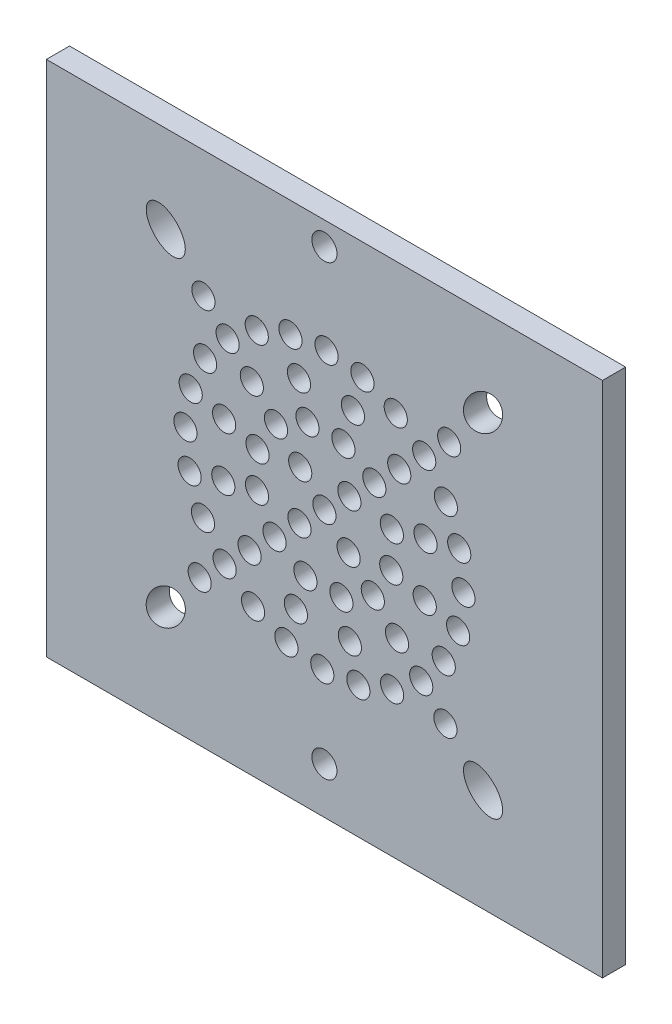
ISO-10303-21;
HEADER;
FILE_DESCRIPTION(('STEP AP214'),'2;1');
FILE_NAME('part.step','',(''),(''),'','','');
FILE_SCHEMA(('AUTOMOTIVE_DESIGN { 1 0 10303 214 1 1 1 1 }'));
ENDSEC;
DATA;
#1=APPLICATION_CONTEXT('core data for automotive mechanical design processes');
#2=APPLICATION_PROTOCOL_DEFINITION('international standard','automotive_design',2000,#1);
#3=PRODUCT_CONTEXT('',#1,'mechanical');
#4=PRODUCT('Part','Part','',(#3));
#5=PRODUCT_RELATED_PRODUCT_CATEGORY('part','',(#4));
#6=PRODUCT_DEFINITION_FORMATION('','',#4);
#7=PRODUCT_DEFINITION_CONTEXT('part definition',#1,'design');
#8=PRODUCT_DEFINITION('design','',#6,#7);
#9=PRODUCT_DEFINITION_SHAPE('','',#8);
#10=(LENGTH_UNIT() NAMED_UNIT(*) SI_UNIT(.MILLI.,.METRE.));
#11=(NAMED_UNIT(*) PLANE_ANGLE_UNIT() SI_UNIT($,.RADIAN.));
#12=(NAMED_UNIT(*) SI_UNIT($,.STERADIAN.) SOLID_ANGLE_UNIT());
#13=UNCERTAINTY_MEASURE_WITH_UNIT(LENGTH_MEASURE(1.E-05),#10,'distance_accuracy_value','');
#14=(GEOMETRIC_REPRESENTATION_CONTEXT(3) GLOBAL_UNCERTAINTY_ASSIGNED_CONTEXT((#13)) GLOBAL_UNIT_ASSIGNED_CONTEXT((#10,
#11,#12)) REPRESENTATION_CONTEXT('',''));
#15=CARTESIAN_POINT('',(0.,0.,0.));
#16=DIRECTION('',(0.,0.,1.));
#17=DIRECTION('',(1.,0.,0.));
#18=AXIS2_PLACEMENT_3D('',#15,#16,#17);
#19=CARTESIAN_POINT('',(158.25,-41.9437052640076,3.));
#20=DIRECTION('',(-1.,0.,0.));
#21=DIRECTION('',(0.,-1.,0.));
#22=AXIS2_PLACEMENT_3D('',#19,#20,#21);
#23=PLANE('',#22);
#24=DIRECTION('',(0.,1.,0.));
#25=VECTOR('',#24,1.);
#26=CARTESIAN_POINT('',(158.25,-41.9437052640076,0.));
#27=LINE('',#26,#25);
#28=CARTESIAN_POINT('',(158.25,-41.9437052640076,0.));
#29=VERTEX_POINT('',#28);
#30=CARTESIAN_POINT('',(158.25,25.0562947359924,0.));
#31=VERTEX_POINT('',#30);
#32=EDGE_CURVE('E100',#29,#31,#27,.T.);
#33=ORIENTED_EDGE('',*,*,#32,.T.);
#34=DIRECTION('',(0.,0.,-1.));
#35=VECTOR('',#34,1.);
#36=CARTESIAN_POINT('',(158.25,25.0562947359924,3.));
#37=LINE('',#36,#35);
#38=CARTESIAN_POINT('',(158.25,25.0562947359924,3.));
#39=VERTEX_POINT('',#38);
#40=EDGE_CURVE('E11',#39,#31,#37,.T.);
#41=ORIENTED_EDGE('',*,*,#40,.F.);
#42=DIRECTION('',(0.,1.,0.));
#43=VECTOR('',#42,1.);
#44=CARTESIAN_POINT('',(158.25,-41.9437052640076,3.));
#45=LINE('',#44,#43);
#46=CARTESIAN_POINT('',(158.25,-41.9437052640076,3.));
#47=VERTEX_POINT('',#46);
#48=EDGE_CURVE('E88',#47,#39,#45,.T.);
#49=ORIENTED_EDGE('',*,*,#48,.F.);
#50=DIRECTION('',(0.,0.,-1.));
#51=VECTOR('',#50,1.);
#52=CARTESIAN_POINT('',(158.25,-41.9437052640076,3.));
#53=LINE('',#52,#51);
#54=EDGE_CURVE('E96',#47,#29,#53,.T.);
#55=ORIENTED_EDGE('',*,*,#54,.T.);
#56=EDGE_LOOP('',(#33,#41,#49,#55));
#57=FACE_BOUND('',#56,.T.);
#58=ADVANCED_FACE('F37',(#57),#23,.F.);
#59=CARTESIAN_POINT('',(158.25,25.0562947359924,3.));
#60=DIRECTION('',(0.,-1.,0.));
#61=DIRECTION('',(1.,0.,0.));
#62=AXIS2_PLACEMENT_3D('',#59,#60,#61);
#63=PLANE('',#62);
#64=DIRECTION('',(-1.,0.,0.));
#65=VECTOR('',#64,1.);
#66=CARTESIAN_POINT('',(158.25,25.0562947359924,0.));
#67=LINE('',#66,#65);
#68=CARTESIAN_POINT('',(86.2499999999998,25.0562947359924,0.));
#69=VERTEX_POINT('',#68);
#70=EDGE_CURVE('E92',#31,#69,#67,.T.);
#71=ORIENTED_EDGE('',*,*,#70,.T.);
#72=DIRECTION('',(0.,0.,-1.));
#73=VECTOR('',#72,1.);
#74=CARTESIAN_POINT('',(86.2499999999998,25.0562947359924,3.));
#75=LINE('',#74,#73);
#76=CARTESIAN_POINT('',(86.2499999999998,25.0562947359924,3.));
#77=VERTEX_POINT('',#76);
#78=EDGE_CURVE('E45',#77,#69,#75,.T.);
#79=ORIENTED_EDGE('',*,*,#78,.F.);
#80=DIRECTION('',(-1.,0.,0.));
#81=VECTOR('',#80,1.);
#82=CARTESIAN_POINT('',(158.25,25.0562947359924,3.));
#83=LINE('',#82,#81);
#84=EDGE_CURVE('E83',#39,#77,#83,.T.);
#85=ORIENTED_EDGE('',*,*,#84,.F.);
#86=ORIENTED_EDGE('',*,*,#40,.T.);
#87=EDGE_LOOP('',(#71,#79,#85,#86));
#88=FACE_BOUND('',#87,.T.);
#89=ADVANCED_FACE('F91',(#88),#63,.F.);
#90=CARTESIAN_POINT('',(86.2499999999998,25.0562947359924,3.));
#91=DIRECTION('',(1.,0.,0.));
#92=DIRECTION('',(0.,0.,-1.));
#93=AXIS2_PLACEMENT_3D('',#90,#91,#92);
#94=PLANE('',#93);
#95=DIRECTION('',(0.,-1.,0.));
#96=VECTOR('',#95,1.);
#97=CARTESIAN_POINT('',(86.2499999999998,25.0562947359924,0.));
#98=LINE('',#97,#96);
#99=CARTESIAN_POINT('',(86.2499999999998,-41.9437052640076,0.));
#100=VERTEX_POINT('',#99);
#101=EDGE_CURVE('E70',#69,#100,#98,.T.);
#102=ORIENTED_EDGE('',*,*,#101,.T.);
#103=DIRECTION('',(0.,0.,-1.));
#104=VECTOR('',#103,1.);
#105=CARTESIAN_POINT('',(86.2499999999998,-41.9437052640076,3.));
#106=LINE('',#105,#104);
#107=CARTESIAN_POINT('',(86.2499999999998,-41.9437052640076,3.));
#108=VERTEX_POINT('',#107);
#109=EDGE_CURVE('E93',#108,#100,#106,.T.);
#110=ORIENTED_EDGE('',*,*,#109,.F.);
#111=DIRECTION('',(0.,-1.,0.));
#112=VECTOR('',#111,1.);
#113=CARTESIAN_POINT('',(86.2499999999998,25.0562947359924,3.));
#114=LINE('',#113,#112);
#115=EDGE_CURVE('E86',#77,#108,#114,.T.);
#116=ORIENTED_EDGE('',*,*,#115,.F.);
#117=ORIENTED_EDGE('',*,*,#78,.T.);
#118=EDGE_LOOP('',(#102,#110,#116,#117));
#119=FACE_BOUND('',#118,.T.);
#120=ADVANCED_FACE('F94',(#119),#94,.F.);
#121=CARTESIAN_POINT('',(86.2499999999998,-41.9437052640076,3.));
#122=DIRECTION('',(0.,1.,0.));
#123=DIRECTION('',(0.,0.,1.));
#124=AXIS2_PLACEMENT_3D('',#121,#122,#123);
#125=PLANE('',#124);
#126=DIRECTION('',(1.,0.,0.));
#127=VECTOR('',#126,1.);
#128=CARTESIAN_POINT('',(86.2499999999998,-41.9437052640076,0.));
#129=LINE('',#128,#127);
#130=EDGE_CURVE('E76',#100,#29,#129,.T.);
#131=ORIENTED_EDGE('',*,*,#130,.T.);
#132=ORIENTED_EDGE('',*,*,#54,.F.);
#133=DIRECTION('',(1.,0.,0.));
#134=VECTOR('',#133,1.);
#135=CARTESIAN_POINT('',(86.2499999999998,-41.9437052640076,3.));
#136=LINE('',#135,#134);
#137=EDGE_CURVE('E53',#108,#47,#136,.T.);
#138=ORIENTED_EDGE('',*,*,#137,.F.);
#139=ORIENTED_EDGE('',*,*,#109,.T.);
#140=EDGE_LOOP('',(#131,#132,#138,#139));
#141=FACE_BOUND('',#140,.T.);
#142=ADVANCED_FACE('F108',(#141),#125,.F.);
#143=CARTESIAN_POINT('',(0.,0.,3.));
#144=DIRECTION('',(0.,0.,1.));
#145=DIRECTION('',(1.,0.,0.));
#146=AXIS2_PLACEMENT_3D('',#143,#144,#145);
#147=PLANE('',#146);
#148=CARTESIAN_POINT('',(122.25,-35.9437052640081,3.));
#149=DIRECTION('',(0.,0.,-1.));
#150=DIRECTION('',(-1.,0.,0.));
#151=AXIS2_PLACEMENT_3D('',#148,#149,#150);
#152=CIRCLE('',#151,1.625);
#153=CARTESIAN_POINT('',(120.625,-35.9437052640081,3.));
#154=VERTEX_POINT('',#153);
#155=EDGE_CURVE('E103',#154,#154,#152,.T.);
#156=ORIENTED_EDGE('',*,*,#155,.T.);
#157=EDGE_LOOP('',(#156));
#158=FACE_BOUND('',#157,.T.);
#159=CARTESIAN_POINT('',(115.789853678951,-13.7100047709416,3.));
#160=DIRECTION('',(0.,0.,-1.));
#161=DIRECTION('',(-1.,0.,0.));
#162=AXIS2_PLACEMENT_3D('',#159,#160,#161);
#163=CIRCLE('',#162,1.49999999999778);
#164=CARTESIAN_POINT('',(114.289853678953,-13.7100047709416,3.));
#165=VERTEX_POINT('',#164);
#166=EDGE_CURVE('E1053',#165,#165,#163,.T.);
#167=ORIENTED_EDGE('',*,*,#166,.T.);
#168=EDGE_LOOP('',(#167));
#169=FACE_BOUND('',#168,.T.);
#170=CARTESIAN_POINT('',(124.446701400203,-16.1715058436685,3.));
#171=DIRECTION('',(0.,0.,-1.));
#172=DIRECTION('',(-1.,0.,0.));
#173=AXIS2_PLACEMENT_3D('',#170,#171,#172);
#174=CIRCLE('',#173,1.49999999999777);
#175=CARTESIAN_POINT('',(122.946701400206,-16.1715058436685,3.));
#176=VERTEX_POINT('',#175);
#177=EDGE_CURVE('E1322',#176,#176,#174,.T.);
#178=ORIENTED_EDGE('',*,*,#177,.T.);
#179=EDGE_LOOP('',(#178));
#180=FACE_BOUND('',#179,.T.);
#181=CARTESIAN_POINT('',(119.788498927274,-16.1005529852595,3.));
#182=DIRECTION('',(0.,0.,-1.));
#183=DIRECTION('',(-1.,0.,0.));
#184=AXIS2_PLACEMENT_3D('',#181,#182,#183);
#185=CIRCLE('',#184,1.49999999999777);
#186=CARTESIAN_POINT('',(118.288498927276,-16.1005529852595,3.));
#187=VERTEX_POINT('',#186);
#188=EDGE_CURVE('E1323',#187,#187,#185,.T.);
#189=ORIENTED_EDGE('',*,*,#188,.T.);
#190=EDGE_LOOP('',(#189));
#191=FACE_BOUND('',#190,.T.);
#192=CARTESIAN_POINT('',(112.559780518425,-16.8431545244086,3.));
#193=DIRECTION('',(0.,0.,-1.));
#194=DIRECTION('',(-1.,0.,0.));
#195=AXIS2_PLACEMENT_3D('',#192,#193,#194);
#196=CIRCLE('',#195,1.49999999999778);
#197=CARTESIAN_POINT('',(111.059780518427,-16.8431545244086,3.));
#198=VERTEX_POINT('',#197);
#199=EDGE_CURVE('E1333',#198,#198,#196,.T.);
#200=ORIENTED_EDGE('',*,*,#199,.T.);
#201=EDGE_LOOP('',(#200));
#202=FACE_BOUND('',#201,.T.);
#203=CARTESIAN_POINT('',(106.526280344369,-16.2052485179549,3.));
#204=DIRECTION('',(0.,0.,-1.));
#205=DIRECTION('',(-1.,0.,0.));
#206=AXIS2_PLACEMENT_3D('',#203,#204,#205);
#207=CIRCLE('',#206,1.49999999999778);
#208=CARTESIAN_POINT('',(105.026280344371,-16.2052485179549,3.));
#209=VERTEX_POINT('',#208);
#210=EDGE_CURVE('E1054',#209,#209,#207,.T.);
#211=ORIENTED_EDGE('',*,*,#210,.T.);
#212=EDGE_LOOP('',(#211));
#213=FACE_BOUND('',#212,.T.);
#214=CARTESIAN_POINT('',(101.710462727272,-28.6186293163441,3.));
#215=DIRECTION('',(0.,0.,-1.));
#216=DIRECTION('',(-0.696255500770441,-0.717794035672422,0.));
#217=AXIS2_PLACEMENT_3D('',#214,#215,#216);
#218=ELLIPSE('',#217,3.,1.99999999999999);
#219=CARTESIAN_POINT('',(99.6216962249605,-30.7720114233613,3.));
#220=VERTEX_POINT('',#219);
#221=EDGE_CURVE('E1061',#220,#220,#218,.T.);
#222=ORIENTED_EDGE('',*,*,#221,.T.);
#223=EDGE_LOOP('',(#222));
#224=FACE_BOUND('',#223,.T.);
#225=CARTESIAN_POINT('',(106.099634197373,-23.1094540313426,3.));
#226=DIRECTION('',(0.,0.,-1.));
#227=DIRECTION('',(-1.,0.,0.));
#228=AXIS2_PLACEMENT_3D('',#225,#226,#227);
#229=CIRCLE('',#228,1.49999999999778);
#230=CARTESIAN_POINT('',(104.599634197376,-23.1094540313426,3.));
#231=VERTEX_POINT('',#230);
#232=EDGE_CURVE('E1040',#231,#231,#229,.T.);
#233=ORIENTED_EDGE('',*,*,#232,.T.);
#234=EDGE_LOOP('',(#233));
#235=FACE_BOUND('',#234,.T.);
#236=CARTESIAN_POINT('',(109.329707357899,-19.9763042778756,3.));
#237=DIRECTION('',(0.,0.,-1.));
#238=DIRECTION('',(-1.,0.,0.));
#239=AXIS2_PLACEMENT_3D('',#236,#237,#238);
#240=CIRCLE('',#239,1.49999999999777);
#241=CARTESIAN_POINT('',(107.829707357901,-19.9763042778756,3.));
#242=VERTEX_POINT('',#241);
#243=EDGE_CURVE('E1047',#242,#242,#240,.T.);
#244=ORIENTED_EDGE('',*,*,#243,.T.);
#245=EDGE_LOOP('',(#244));
#246=FACE_BOUND('',#245,.T.);
#247=CARTESIAN_POINT('',(109.158299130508,-10.7387573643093,3.));
#248=DIRECTION('',(0.,0.,-1.));
#249=DIRECTION('',(-1.,0.,0.));
#250=AXIS2_PLACEMENT_3D('',#247,#248,#249);
#251=CIRCLE('',#250,1.49999999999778);
#252=CARTESIAN_POINT('',(107.65829913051,-10.7387573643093,3.));
#253=VERTEX_POINT('',#252);
#254=EDGE_CURVE('E1275',#253,#253,#251,.T.);
#255=ORIENTED_EDGE('',*,*,#254,.T.);
#256=EDGE_LOOP('',(#255));
#257=FACE_BOUND('',#256,.T.);
#258=CARTESIAN_POINT('',(104.794398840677,-11.8371080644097,3.));
#259=DIRECTION('',(0.,0.,-1.));
#260=DIRECTION('',(-1.,0.,0.));
#261=AXIS2_PLACEMENT_3D('',#258,#259,#260);
#262=CIRCLE('',#261,1.49999999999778);
#263=CARTESIAN_POINT('',(103.294398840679,-11.8371080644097,3.));
#264=VERTEX_POINT('',#263);
#265=EDGE_CURVE('E1281',#264,#264,#262,.T.);
#266=ORIENTED_EDGE('',*,*,#265,.T.);
#267=EDGE_LOOP('',(#266));
#268=FACE_BOUND('',#267,.T.);
#269=CARTESIAN_POINT('',(113.522199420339,-9.64040666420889,3.));
#270=DIRECTION('',(0.,0.,-1.));
#271=DIRECTION('',(-1.,0.,0.));
#272=AXIS2_PLACEMENT_3D('',#269,#270,#271);
#273=CIRCLE('',#272,1.49999999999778);
#274=CARTESIAN_POINT('',(112.022199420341,-9.64040666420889,3.));
#275=VERTEX_POINT('',#274);
#276=EDGE_CURVE('E1287',#275,#275,#273,.T.);
#277=ORIENTED_EDGE('',*,*,#276,.T.);
#278=EDGE_LOOP('',(#277));
#279=FACE_BOUND('',#278,.T.);
#280=CARTESIAN_POINT('',(119.019926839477,-10.5768550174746,3.));
#281=DIRECTION('',(0.,0.,-1.));
#282=DIRECTION('',(-1.,0.,0.));
#283=AXIS2_PLACEMENT_3D('',#280,#281,#282);
#284=CIRCLE('',#283,1.49999999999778);
#285=CARTESIAN_POINT('',(117.519926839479,-10.5768550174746,3.));
#286=VERTEX_POINT('',#285);
#287=EDGE_CURVE('E1293',#286,#286,#284,.T.);
#288=ORIENTED_EDGE('',*,*,#287,.T.);
#289=EDGE_LOOP('',(#288));
#290=FACE_BOUND('',#289,.T.);
#291=CARTESIAN_POINT('',(125.38314975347,-10.6737784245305,3.));
#292=DIRECTION('',(0.,0.,-1.));
#293=DIRECTION('',(-1.,0.,0.));
#294=AXIS2_PLACEMENT_3D('',#291,#292,#293);
#295=CIRCLE('',#294,1.49999999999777);
#296=CARTESIAN_POINT('',(123.883149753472,-10.6737784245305,3.));
#297=VERTEX_POINT('',#296);
#298=EDGE_CURVE('E1299',#297,#297,#295,.T.);
#299=ORIENTED_EDGE('',*,*,#298,.T.);
#300=EDGE_LOOP('',(#299));
#301=FACE_BOUND('',#300,.T.);
#302=CARTESIAN_POINT('',(122.25,-7.44370526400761,3.));
#303=DIRECTION('',(0.,0.,-1.));
#304=DIRECTION('',(-1.,0.,0.));
#305=AXIS2_PLACEMENT_3D('',#302,#303,#304);
#306=CIRCLE('',#305,1.49999999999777);
#307=CARTESIAN_POINT('',(120.750000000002,-7.44370526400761,3.));
#308=VERTEX_POINT('',#307);
#309=EDGE_CURVE('E1305',#308,#308,#306,.T.);
#310=ORIENTED_EDGE('',*,*,#309,.T.);
#311=EDGE_LOOP('',(#310));
#312=FACE_BOUND('',#311,.T.);
#313=CARTESIAN_POINT('',(130.906847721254,-9.90520633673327,3.));
#314=DIRECTION('',(0.,0.,-1.));
#315=DIRECTION('',(-1.,0.,0.));
#316=AXIS2_PLACEMENT_3D('',#313,#314,#315);
#317=CIRCLE('',#316,1.49999999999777);
#318=CARTESIAN_POINT('',(129.406847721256,-9.90520633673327,3.));
#319=VERTEX_POINT('',#318);
#320=EDGE_CURVE('E1311',#319,#319,#317,.T.);
#321=ORIENTED_EDGE('',*,*,#320,.T.);
#322=EDGE_LOOP('',(#321));
#323=FACE_BOUND('',#322,.T.);
#324=CARTESIAN_POINT('',(130.977800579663,-5.24700386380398,3.));
#325=DIRECTION('',(0.,0.,-1.));
#326=DIRECTION('',(-1.,0.,0.));
#327=AXIS2_PLACEMENT_3D('',#324,#325,#326);
#328=CIRCLE('',#327,1.49999999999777);
#329=CARTESIAN_POINT('',(129.477800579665,-5.24700386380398,3.));
#330=VERTEX_POINT('',#329);
#331=EDGE_CURVE('E1219',#330,#330,#328,.T.);
#332=ORIENTED_EDGE('',*,*,#331,.T.);
#333=EDGE_LOOP('',(#332));
#334=FACE_BOUND('',#333,.T.);
#335=CARTESIAN_POINT('',(126.643402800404,-24.8993064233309,3.));
#336=DIRECTION('',(0.,0.,-1.));
#337=DIRECTION('',(-1.,0.,0.));
#338=AXIS2_PLACEMENT_3D('',#335,#336,#337);
#339=CIRCLE('',#338,1.49999999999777);
#340=CARTESIAN_POINT('',(125.143402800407,-24.8993064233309,3.));
#341=VERTEX_POINT('',#340);
#342=EDGE_CURVE('E984',#341,#341,#339,.T.);
#343=ORIENTED_EDGE('',*,*,#342,.T.);
#344=EDGE_LOOP('',(#343));
#345=FACE_BOUND('',#344,.T.);
#346=CARTESIAN_POINT('',(131.011543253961,-23.167424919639,3.));
#347=DIRECTION('',(0.,0.,-1.));
#348=DIRECTION('',(-1.,0.,0.));
#349=AXIS2_PLACEMENT_3D('',#346,#347,#348);
#350=CIRCLE('',#349,1.49999999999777);
#351=CARTESIAN_POINT('',(129.511543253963,-23.167424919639,3.));
#352=VERTEX_POINT('',#351);
#353=EDGE_CURVE('E978',#352,#352,#350,.T.);
#354=ORIENTED_EDGE('',*,*,#353,.T.);
#355=EDGE_LOOP('',(#354));
#356=FACE_BOUND('',#355,.T.);
#357=CARTESIAN_POINT('',(134.782599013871,-20.3639979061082,3.));
#358=DIRECTION('',(0.,0.,-1.));
#359=DIRECTION('',(-1.,0.,0.));
#360=AXIS2_PLACEMENT_3D('',#357,#358,#359);
#361=CIRCLE('',#360,1.49999999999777);
#362=CARTESIAN_POINT('',(133.282599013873,-20.3639979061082,3.));
#363=VERTEX_POINT('',#362);
#364=EDGE_CURVE('E972',#363,#363,#361,.T.);
#365=ORIENTED_EDGE('',*,*,#364,.T.);
#366=EDGE_LOOP('',(#365));
#367=FACE_BOUND('',#366,.T.);
#368=CARTESIAN_POINT('',(142.789537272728,-28.6186293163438,3.));
#369=DIRECTION('',(0.,0.,-1.));
#370=DIRECTION('',(0.69625550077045,-0.717794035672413,0.));
#371=AXIS2_PLACEMENT_3D('',#368,#369,#370);
#372=ELLIPSE('',#371,3.,2.);
#373=CARTESIAN_POINT('',(144.878303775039,-30.772011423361,3.));
#374=VERTEX_POINT('',#373);
#375=EDGE_CURVE('E962',#374,#374,#372,.T.);
#376=ORIENTED_EDGE('',*,*,#375,.T.);
#377=EDGE_LOOP('',(#376));
#378=FACE_BOUND('',#377,.T.);
#379=CARTESIAN_POINT('',(137.699578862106,-16.6800743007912,3.));
#380=DIRECTION('',(0.,0.,-1.));
#381=DIRECTION('',(-1.,0.,0.));
#382=AXIS2_PLACEMENT_3D('',#379,#380,#381);
#383=CIRCLE('',#382,1.49999999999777);
#384=CARTESIAN_POINT('',(136.199578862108,-16.6800743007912,3.));
#385=VERTEX_POINT('',#384);
#386=EDGE_CURVE('E1454',#385,#385,#383,.T.);
#387=ORIENTED_EDGE('',*,*,#386,.T.);
#388=EDGE_LOOP('',(#387));
#389=FACE_BOUND('',#388,.T.);
#390=CARTESIAN_POINT('',(139.563695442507,-12.3667074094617,3.));
#391=DIRECTION('',(0.,0.,-1.));
#392=DIRECTION('',(-1.,0.,0.));
#393=AXIS2_PLACEMENT_3D('',#390,#391,#392);
#394=CIRCLE('',#393,1.49999999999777);
#395=CARTESIAN_POINT('',(138.063695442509,-12.3667074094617,3.));
#396=VERTEX_POINT('',#395);
#397=EDGE_CURVE('E1039',#396,#396,#394,.T.);
#398=ORIENTED_EDGE('',*,*,#397,.T.);
#399=EDGE_LOOP('',(#398));
#400=FACE_BOUND('',#399,.T.);
#401=CARTESIAN_POINT('',(135.23527158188,-11.1359568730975,3.));
#402=DIRECTION('',(0.,0.,-1.));
#403=DIRECTION('',(-1.,0.,0.));
#404=AXIS2_PLACEMENT_3D('',#401,#402,#403);
#405=CIRCLE('',#404,1.49999999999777);
#406=CARTESIAN_POINT('',(133.735271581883,-11.1359568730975,3.));
#407=VERTEX_POINT('',#406);
#408=EDGE_CURVE('E1033',#407,#407,#405,.T.);
#409=ORIENTED_EDGE('',*,*,#408,.T.);
#410=EDGE_LOOP('',(#409));
#411=FACE_BOUND('',#410,.T.);
#412=CARTESIAN_POINT('',(131.649449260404,-17.1339247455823,3.));
#413=DIRECTION('',(0.,0.,-1.));
#414=DIRECTION('',(-1.,0.,0.));
#415=AXIS2_PLACEMENT_3D('',#412,#413,#414);
#416=CIRCLE('',#415,1.49999999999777);
#417=CARTESIAN_POINT('',(130.149449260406,-17.1339247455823,3.));
#418=VERTEX_POINT('',#417);
#419=EDGE_CURVE('E1027',#418,#418,#416,.T.);
#420=ORIENTED_EDGE('',*,*,#419,.T.);
#421=EDGE_LOOP('',(#420));
#422=FACE_BOUND('',#421,.T.);
#423=CARTESIAN_POINT('',(128.516299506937,-13.9038515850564,3.));
#424=DIRECTION('',(0.,0.,-1.));
#425=DIRECTION('',(-1.,0.,0.));
#426=AXIS2_PLACEMENT_3D('',#423,#424,#425);
#427=CIRCLE('',#426,1.49999999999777);
#428=CARTESIAN_POINT('',(127.016299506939,-13.9038515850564,3.));
#429=VERTEX_POINT('',#428);
#430=EDGE_CURVE('E1021',#429,#429,#427,.T.);
#431=ORIENTED_EDGE('',*,*,#430,.T.);
#432=EDGE_LOOP('',(#431));
#433=FACE_BOUND('',#432,.T.);
#434=CARTESIAN_POINT('',(125.545052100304,-20.5354061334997,3.));
#435=DIRECTION('',(0.,0.,-1.));
#436=DIRECTION('',(-1.,0.,0.));
#437=AXIS2_PLACEMENT_3D('',#434,#435,#436);
#438=CIRCLE('',#437,1.49999999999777);
#439=CARTESIAN_POINT('',(124.045052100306,-20.5354061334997,3.));
#440=VERTEX_POINT('',#439);
#441=EDGE_CURVE('E1003',#440,#440,#438,.T.);
#442=ORIENTED_EDGE('',*,*,#441,.T.);
#443=EDGE_LOOP('',(#442));
#444=FACE_BOUND('',#443,.T.);
#445=CARTESIAN_POINT('',(118.55774839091,-20.4289768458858,3.));
#446=DIRECTION('',(0.,0.,-1.));
#447=DIRECTION('',(-1.,0.,0.));
#448=AXIS2_PLACEMENT_3D('',#445,#446,#447);
#449=CIRCLE('',#448,1.49999999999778);
#450=CARTESIAN_POINT('',(117.057748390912,-20.4289768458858,3.));
#451=VERTEX_POINT('',#450);
#452=EDGE_CURVE('E1004',#451,#451,#449,.T.);
#453=ORIENTED_EDGE('',*,*,#452,.T.);
#454=EDGE_LOOP('',(#453));
#455=FACE_BOUND('',#454,.T.);
#456=CARTESIAN_POINT('',(113.013630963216,-22.8932841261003,3.));
#457=DIRECTION('',(0.,0.,-1.));
#458=DIRECTION('',(-1.,0.,0.));
#459=AXIS2_PLACEMENT_3D('',#456,#457,#458);
#460=CIRCLE('',#459,1.49999999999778);
#461=CARTESIAN_POINT('',(111.513630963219,-22.8932841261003,3.));
#462=VERTEX_POINT('',#461);
#463=EDGE_CURVE('E1011',#462,#462,#460,.T.);
#464=ORIENTED_EDGE('',*,*,#463,.T.);
#465=EDGE_LOOP('',(#464));
#466=FACE_BOUND('',#465,.T.);
#467=CARTESIAN_POINT('',(117.326997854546,-24.7574007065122,3.));
#468=DIRECTION('',(0.,0.,-1.));
#469=DIRECTION('',(-1.,0.,0.));
#470=AXIS2_PLACEMENT_3D('',#467,#468,#469);
#471=CIRCLE('',#470,1.49999999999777);
#472=CARTESIAN_POINT('',(115.826997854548,-24.7574007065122,3.));
#473=VERTEX_POINT('',#472);
#474=EDGE_CURVE('E990',#473,#473,#471,.T.);
#475=ORIENTED_EDGE('',*,*,#474,.T.);
#476=EDGE_LOOP('',(#475));
#477=FACE_BOUND('',#476,.T.);
#478=CARTESIAN_POINT('',(121.975859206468,-25.4416175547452,3.));
#479=DIRECTION('',(0.,0.,-1.));
#480=DIRECTION('',(-1.,0.,0.));
#481=AXIS2_PLACEMENT_3D('',#478,#479,#480);
#482=CIRCLE('',#481,1.49999999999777);
#483=CARTESIAN_POINT('',(120.47585920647,-25.4416175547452,3.));
#484=VERTEX_POINT('',#483);
#485=EDGE_CURVE('E997',#484,#484,#482,.T.);
#486=ORIENTED_EDGE('',*,*,#485,.T.);
#487=EDGE_LOOP('',(#486));
#488=FACE_BOUND('',#487,.T.);
#489=CARTESIAN_POINT('',(113.488456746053,8.28001439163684,3.));
#490=DIRECTION('',(0.,0.,-1.));
#491=DIRECTION('',(-1.,0.,0.));
#492=AXIS2_PLACEMENT_3D('',#489,#490,#491);
#493=CIRCLE('',#492,1.49999999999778);
#494=CARTESIAN_POINT('',(111.988456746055,8.28001439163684,3.));
#495=VERTEX_POINT('',#494);
#496=EDGE_CURVE('E1104',#495,#495,#493,.T.);
#497=ORIENTED_EDGE('',*,*,#496,.T.);
#498=EDGE_LOOP('',(#497));
#499=FACE_BOUND('',#498,.T.);
#500=CARTESIAN_POINT('',(118.954947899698,5.64799560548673,3.));
#501=DIRECTION('',(0.,0.,-1.));
#502=DIRECTION('',(-1.,0.,0.));
#503=AXIS2_PLACEMENT_3D('',#500,#501,#502);
#504=CIRCLE('',#503,1.49999999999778);
#505=CARTESIAN_POINT('',(117.4549478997,5.64799560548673,3.));
#506=VERTEX_POINT('',#505);
#507=EDGE_CURVE('E1097',#506,#506,#504,.T.);
#508=ORIENTED_EDGE('',*,*,#507,.T.);
#509=EDGE_LOOP('',(#508));
#510=FACE_BOUND('',#509,.T.);
#511=CARTESIAN_POINT('',(117.856597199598,10.0118958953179,3.));
#512=DIRECTION('',(0.,0.,-1.));
#513=DIRECTION('',(-1.,0.,0.));
#514=AXIS2_PLACEMENT_3D('',#511,#512,#513);
#515=CIRCLE('',#514,1.49999999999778);
#516=CARTESIAN_POINT('',(116.3565971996,10.0118958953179,3.));
#517=VERTEX_POINT('',#516);
#518=EDGE_CURVE('E1116',#517,#517,#515,.T.);
#519=ORIENTED_EDGE('',*,*,#518,.T.);
#520=EDGE_LOOP('',(#519));
#521=FACE_BOUND('',#520,.T.);
#522=CARTESIAN_POINT('',(122.524140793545,10.5542070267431,3.));
#523=DIRECTION('',(0.,0.,-1.));
#524=DIRECTION('',(-1.,0.,0.));
#525=AXIS2_PLACEMENT_3D('',#522,#523,#524);
#526=CIRCLE('',#525,1.49999999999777);
#527=CARTESIAN_POINT('',(121.024140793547,10.5542070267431,3.));
#528=VERTEX_POINT('',#527);
#529=EDGE_CURVE('E1109',#528,#528,#526,.T.);
#530=ORIENTED_EDGE('',*,*,#529,.T.);
#531=EDGE_LOOP('',(#530));
#532=FACE_BOUND('',#531,.T.);
#533=CARTESIAN_POINT('',(101.710462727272,13.7312187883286,3.));
#534=DIRECTION('',(0.,0.,-1.));
#535=DIRECTION('',(-0.690448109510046,0.723381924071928,0.));
#536=AXIS2_PLACEMENT_3D('',#533,#534,#535);
#537=ELLIPSE('',#536,3.,2.);
#538=CARTESIAN_POINT('',(99.6391183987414,15.9013645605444,3.));
#539=VERTEX_POINT('',#538);
#540=EDGE_CURVE('E1067',#539,#539,#537,.T.);
#541=ORIENTED_EDGE('',*,*,#540,.T.);
#542=EDGE_LOOP('',(#541));
#543=FACE_BOUND('',#542,.T.);
#544=CARTESIAN_POINT('',(106.584251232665,8.70666053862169,3.));
#545=DIRECTION('',(0.,0.,-1.));
#546=DIRECTION('',(-1.,0.,0.));
#547=AXIS2_PLACEMENT_3D('',#544,#545,#546);
#548=CIRCLE('',#547,1.49999999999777);
#549=CARTESIAN_POINT('',(105.084251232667,8.70666053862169,3.));
#550=VERTEX_POINT('',#549);
#551=EDGE_CURVE('E1078',#550,#550,#548,.T.);
#552=ORIENTED_EDGE('',*,*,#551,.T.);
#553=EDGE_LOOP('',(#552));
#554=FACE_BOUND('',#553,.T.);
#555=CARTESIAN_POINT('',(109.717400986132,5.47658737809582,3.));
#556=DIRECTION('',(0.,0.,-1.));
#557=DIRECTION('',(-1.,0.,0.));
#558=AXIS2_PLACEMENT_3D('',#555,#556,#557);
#559=CIRCLE('',#558,1.49999999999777);
#560=CARTESIAN_POINT('',(108.217400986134,5.47658737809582,3.));
#561=VERTEX_POINT('',#560);
#562=EDGE_CURVE('E1084',#561,#561,#559,.T.);
#563=ORIENTED_EDGE('',*,*,#562,.T.);
#564=EDGE_LOOP('',(#563));
#565=FACE_BOUND('',#564,.T.);
#566=CARTESIAN_POINT('',(112.850550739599,2.24651421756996,3.));
#567=DIRECTION('',(0.,0.,-1.));
#568=DIRECTION('',(-1.,0.,0.));
#569=AXIS2_PLACEMENT_3D('',#566,#567,#568);
#570=CIRCLE('',#569,1.49999999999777);
#571=CARTESIAN_POINT('',(111.350550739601,2.24651421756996,3.));
#572=VERTEX_POINT('',#571);
#573=EDGE_CURVE('E1090',#572,#572,#570,.T.);
#574=ORIENTED_EDGE('',*,*,#573,.T.);
#575=EDGE_LOOP('',(#574));
#576=FACE_BOUND('',#575,.T.);
#577=CARTESIAN_POINT('',(138.400365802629,8.22204350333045,3.));
#578=DIRECTION('',(0.,0.,-1.));
#579=DIRECTION('',(-1.,0.,0.));
#580=AXIS2_PLACEMENT_3D('',#577,#578,#579);
#581=CIRCLE('',#580,1.49999999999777);
#582=CARTESIAN_POINT('',(136.900365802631,8.22204350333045,3.));
#583=VERTEX_POINT('',#582);
#584=EDGE_CURVE('E131',#583,#583,#581,.T.);
#585=ORIENTED_EDGE('',*,*,#584,.T.);
#586=EDGE_LOOP('',(#585));
#587=FACE_BOUND('',#586,.T.);
#588=CARTESIAN_POINT('',(142.789537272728,13.7312187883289,3.));
#589=DIRECTION('',(0.,0.,-1.));
#590=DIRECTION('',(-0.696255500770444,-0.71779403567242,0.));
#591=AXIS2_PLACEMENT_3D('',#588,#589,#590);
#592=ELLIPSE('',#591,2.99999999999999,1.99999999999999);
#593=CARTESIAN_POINT('',(140.700770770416,11.5778366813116,3.));
#594=VERTEX_POINT('',#593);
#595=EDGE_CURVE('E118',#594,#594,#592,.T.);
#596=ORIENTED_EDGE('',*,*,#595,.T.);
#597=EDGE_LOOP('',(#596));
#598=FACE_BOUND('',#597,.T.);
#599=CARTESIAN_POINT('',(137.915748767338,-23.5940710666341,3.));
#600=DIRECTION('',(0.,0.,-1.));
#601=DIRECTION('',(-1.,0.,0.));
#602=AXIS2_PLACEMENT_3D('',#599,#600,#601);
#603=CIRCLE('',#602,1.49999999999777);
#604=CARTESIAN_POINT('',(136.41574876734,-23.5940710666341,3.));
#605=VERTEX_POINT('',#604);
#606=EDGE_CURVE('E117',#605,#605,#603,.T.);
#607=ORIENTED_EDGE('',*,*,#606,.T.);
#608=EDGE_LOOP('',(#607));
#609=FACE_BOUND('',#608,.T.);
#610=CARTESIAN_POINT('',(122.25,22.0562947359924,3.));
#611=DIRECTION('',(0.,0.,-1.));
#612=DIRECTION('',(-1.,0.,0.));
#613=AXIS2_PLACEMENT_3D('',#610,#611,#612);
#614=CIRCLE('',#613,1.625);
#615=CARTESIAN_POINT('',(120.625,22.0562947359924,3.));
#616=VERTEX_POINT('',#615);
#617=EDGE_CURVE('E124',#616,#616,#614,.T.);
#618=ORIENTED_EDGE('',*,*,#617,.T.);
#619=EDGE_LOOP('',(#618));
#620=FACE_BOUND('',#619,.T.);
#621=CARTESIAN_POINT('',(125.942251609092,5.54156631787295,3.));
#622=DIRECTION('',(0.,0.,-1.));
#623=DIRECTION('',(-1.,0.,0.));
#624=AXIS2_PLACEMENT_3D('',#621,#622,#623);
#625=CIRCLE('',#624,1.49999999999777);
#626=CARTESIAN_POINT('',(124.442251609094,5.54156631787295,3.));
#627=VERTEX_POINT('',#626);
#628=EDGE_CURVE('E1127',#627,#627,#625,.T.);
#629=ORIENTED_EDGE('',*,*,#628,.T.);
#630=EDGE_LOOP('',(#629));
#631=FACE_BOUND('',#630,.T.);
#632=CARTESIAN_POINT('',(131.486369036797,8.00587359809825,3.));
#633=DIRECTION('',(0.,0.,-1.));
#634=DIRECTION('',(-1.,0.,0.));
#635=AXIS2_PLACEMENT_3D('',#632,#633,#634);
#636=CIRCLE('',#635,1.49999999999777);
#637=CARTESIAN_POINT('',(129.986369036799,8.00587359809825,3.));
#638=VERTEX_POINT('',#637);
#639=EDGE_CURVE('E1121',#638,#638,#636,.T.);
#640=ORIENTED_EDGE('',*,*,#639,.T.);
#641=EDGE_LOOP('',(#640));
#642=FACE_BOUND('',#641,.T.);
#643=CARTESIAN_POINT('',(127.173002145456,9.86999017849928,3.));
#644=DIRECTION('',(0.,0.,-1.));
#645=DIRECTION('',(-1.,0.,0.));
#646=AXIS2_PLACEMENT_3D('',#643,#644,#645);
#647=CIRCLE('',#646,1.49999999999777);
#648=CARTESIAN_POINT('',(125.673002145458,9.86999017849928,3.));
#649=VERTEX_POINT('',#648);
#650=EDGE_CURVE('E1136',#649,#649,#647,.T.);
#651=ORIENTED_EDGE('',*,*,#650,.T.);
#652=EDGE_LOOP('',(#651));
#653=FACE_BOUND('',#652,.T.);
#654=CARTESIAN_POINT('',(135.170292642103,5.08889374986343,3.));
#655=DIRECTION('',(0.,0.,-1.));
#656=DIRECTION('',(-1.,0.,0.));
#657=AXIS2_PLACEMENT_3D('',#654,#655,#656);
#658=CIRCLE('',#657,1.49999999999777);
#659=CARTESIAN_POINT('',(133.670292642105,5.08889374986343,3.));
#660=VERTEX_POINT('',#659);
#661=EDGE_CURVE('E132',#660,#660,#658,.T.);
#662=ORIENTED_EDGE('',*,*,#661,.T.);
#663=EDGE_LOOP('',(#662));
#664=FACE_BOUND('',#663,.T.);
#665=CARTESIAN_POINT('',(109.264728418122,-3.75145365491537,3.));
#666=DIRECTION('',(0.,0.,-1.));
#667=DIRECTION('',(-1.,0.,0.));
#668=AXIS2_PLACEMENT_3D('',#665,#666,#667);
#669=CIRCLE('',#668,1.49999999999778);
#670=CARTESIAN_POINT('',(107.764728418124,-3.75145365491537,3.));
#671=VERTEX_POINT('',#670);
#672=EDGE_CURVE('E1267',#671,#671,#669,.T.);
#673=ORIENTED_EDGE('',*,*,#672,.T.);
#674=EDGE_LOOP('',(#673));
#675=FACE_BOUND('',#674,.T.);
#676=CARTESIAN_POINT('',(104.936304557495,-2.52070311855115,3.));
#677=DIRECTION('',(0.,0.,-1.));
#678=DIRECTION('',(-1.,0.,0.));
#679=AXIS2_PLACEMENT_3D('',#676,#677,#678);
#680=CIRCLE('',#679,1.49999999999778);
#681=CARTESIAN_POINT('',(103.436304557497,-2.52070311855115,3.));
#682=VERTEX_POINT('',#681);
#683=EDGE_CURVE('E1260',#682,#682,#680,.T.);
#684=ORIENTED_EDGE('',*,*,#683,.T.);
#685=EDGE_LOOP('',(#684));
#686=FACE_BOUND('',#685,.T.);
#687=CARTESIAN_POINT('',(104.252087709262,-7.16956447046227,3.));
#688=DIRECTION('',(0.,0.,-1.));
#689=DIRECTION('',(-1.,0.,0.));
#690=AXIS2_PLACEMENT_3D('',#687,#688,#689);
#691=CIRCLE('',#690,1.49999999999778);
#692=CARTESIAN_POINT('',(102.752087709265,-7.16956447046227,3.));
#693=VERTEX_POINT('',#692);
#694=EDGE_CURVE('E1259',#693,#693,#691,.T.);
#695=ORIENTED_EDGE('',*,*,#694,.T.);
#696=EDGE_LOOP('',(#695));
#697=FACE_BOUND('',#696,.T.);
#698=CARTESIAN_POINT('',(106.800421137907,1.79266377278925,3.));
#699=DIRECTION('',(0.,0.,-1.));
#700=DIRECTION('',(-1.,0.,0.));
#701=AXIS2_PLACEMENT_3D('',#698,#699,#700);
#702=CIRCLE('',#701,1.49999999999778);
#703=CARTESIAN_POINT('',(105.30042113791,1.79266377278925,3.));
#704=VERTEX_POINT('',#703);
#705=EDGE_CURVE('E1096',#704,#704,#702,.T.);
#706=ORIENTED_EDGE('',*,*,#705,.T.);
#707=EDGE_LOOP('',(#706));
#708=FACE_BOUND('',#707,.T.);
#709=CARTESIAN_POINT('',(113.593152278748,-4.98220419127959,3.));
#710=DIRECTION('',(0.,0.,-1.));
#711=DIRECTION('',(-1.,0.,0.));
#712=AXIS2_PLACEMENT_3D('',#709,#710,#711);
#713=CIRCLE('',#712,1.49999999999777);
#714=CARTESIAN_POINT('',(112.09315227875,-4.98220419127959,3.));
#715=VERTEX_POINT('',#714);
#716=EDGE_CURVE('E1255',#715,#715,#713,.T.);
#717=ORIENTED_EDGE('',*,*,#716,.T.);
#718=EDGE_LOOP('',(#717));
#719=FACE_BOUND('',#718,.T.);
#720=CARTESIAN_POINT('',(115.983700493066,-0.983558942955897,3.));
#721=DIRECTION('',(0.,0.,-1.));
#722=DIRECTION('',(-1.,0.,0.));
#723=AXIS2_PLACEMENT_3D('',#720,#721,#722);
#724=CIRCLE('',#723,1.49999999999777);
#725=CARTESIAN_POINT('',(114.483700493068,-0.983558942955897,3.));
#726=VERTEX_POINT('',#725);
#727=EDGE_CURVE('E1251',#726,#726,#724,.T.);
#728=ORIENTED_EDGE('',*,*,#727,.T.);
#729=EDGE_LOOP('',(#728));
#730=FACE_BOUND('',#729,.T.);
#731=CARTESIAN_POINT('',(119.116850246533,-4.21363210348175,3.));
#732=DIRECTION('',(0.,0.,-1.));
#733=DIRECTION('',(-1.,0.,0.));
#734=AXIS2_PLACEMENT_3D('',#731,#732,#733);
#735=CIRCLE('',#734,1.49999999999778);
#736=CARTESIAN_POINT('',(117.616850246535,-4.21363210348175,3.));
#737=VERTEX_POINT('',#736);
#738=EDGE_CURVE('E1247',#737,#737,#735,.T.);
#739=ORIENTED_EDGE('',*,*,#738,.T.);
#740=EDGE_LOOP('',(#739));
#741=FACE_BOUND('',#740,.T.);
#742=CARTESIAN_POINT('',(120.053298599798,1.28409531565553,3.));
#743=DIRECTION('',(0.,0.,-1.));
#744=DIRECTION('',(-1.,0.,0.));
#745=AXIS2_PLACEMENT_3D('',#742,#743,#744);
#746=CIRCLE('',#745,1.49999999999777);
#747=CARTESIAN_POINT('',(118.553298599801,1.28409531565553,3.));
#748=VERTEX_POINT('',#747);
#749=EDGE_CURVE('E1243',#748,#748,#746,.T.);
#750=ORIENTED_EDGE('',*,*,#749,.T.);
#751=EDGE_LOOP('',(#750));
#752=FACE_BOUND('',#751,.T.);
#753=CARTESIAN_POINT('',(131.940219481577,1.95574399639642,3.));
#754=DIRECTION('',(0.,0.,-1.));
#755=DIRECTION('',(-1.,0.,0.));
#756=AXIS2_PLACEMENT_3D('',#753,#754,#755);
#757=CIRCLE('',#756,1.49999999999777);
#758=CARTESIAN_POINT('',(130.44021948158,1.95574399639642,3.));
#759=VERTEX_POINT('',#758);
#760=EDGE_CURVE('E1236',#759,#759,#757,.T.);
#761=ORIENTED_EDGE('',*,*,#760,.T.);
#762=EDGE_LOOP('',(#761));
#763=FACE_BOUND('',#762,.T.);
#764=CARTESIAN_POINT('',(125.480073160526,-4.31055551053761,3.));
#765=DIRECTION('',(0.,0.,-1.));
#766=DIRECTION('',(-1.,0.,0.));
#767=AXIS2_PLACEMENT_3D('',#764,#765,#766);
#768=CIRCLE('',#767,1.49999999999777);
#769=CARTESIAN_POINT('',(123.980073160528,-4.31055551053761,3.));
#770=VERTEX_POINT('',#769);
#771=EDGE_CURVE('E1228',#770,#770,#768,.T.);
#772=ORIENTED_EDGE('',*,*,#771,.T.);
#773=EDGE_LOOP('',(#772));
#774=FACE_BOUND('',#773,.T.);
#775=CARTESIAN_POINT('',(128.710146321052,-1.1774057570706,3.));
#776=DIRECTION('',(0.,0.,-1.));
#777=DIRECTION('',(-1.,0.,0.));
#778=AXIS2_PLACEMENT_3D('',#775,#776,#777);
#779=CIRCLE('',#778,1.49999999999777);
#780=CARTESIAN_POINT('',(127.210146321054,-1.1774057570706,3.));
#781=VERTEX_POINT('',#780);
#782=EDGE_CURVE('E1227',#781,#781,#779,.T.);
#783=ORIENTED_EDGE('',*,*,#782,.T.);
#784=EDGE_LOOP('',(#783));
#785=FACE_BOUND('',#784,.T.);
#786=CARTESIAN_POINT('',(124.711501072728,1.21314245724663,3.));
#787=DIRECTION('',(0.,0.,-1.));
#788=DIRECTION('',(-1.,0.,0.));
#789=AXIS2_PLACEMENT_3D('',#786,#787,#788);
#790=CIRCLE('',#789,1.49999999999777);
#791=CARTESIAN_POINT('',(123.21150107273,1.21314245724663,3.));
#792=VERTEX_POINT('',#791);
#793=EDGE_CURVE('E1232',#792,#792,#790,.T.);
#794=ORIENTED_EDGE('',*,*,#793,.T.);
#795=EDGE_LOOP('',(#794));
#796=FACE_BOUND('',#795,.T.);
#797=CARTESIAN_POINT('',(135.341700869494,-4.14865316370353,3.));
#798=DIRECTION('',(0.,0.,-1.));
#799=DIRECTION('',(-1.,0.,0.));
#800=AXIS2_PLACEMENT_3D('',#797,#798,#799);
#801=CIRCLE('',#800,1.49999999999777);
#802=CARTESIAN_POINT('',(133.841700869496,-4.14865316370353,3.));
#803=VERTEX_POINT('',#802);
#804=EDGE_CURVE('E1218',#803,#803,#801,.T.);
#805=ORIENTED_EDGE('',*,*,#804,.T.);
#806=EDGE_LOOP('',(#805));
#807=FACE_BOUND('',#806,.T.);
#808=CARTESIAN_POINT('',(139.705601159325,-3.05030246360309,3.));
#809=DIRECTION('',(0.,0.,-1.));
#810=DIRECTION('',(-1.,0.,0.));
#811=AXIS2_PLACEMENT_3D('',#808,#809,#810);
#812=CIRCLE('',#811,1.49999999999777);
#813=CARTESIAN_POINT('',(138.205601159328,-3.05030246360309,3.));
#814=VERTEX_POINT('',#813);
#815=EDGE_CURVE('E1223',#814,#814,#812,.T.);
#816=ORIENTED_EDGE('',*,*,#815,.T.);
#817=EDGE_LOOP('',(#816));
#818=FACE_BOUND('',#817,.T.);
#819=CARTESIAN_POINT('',(140.247912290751,-7.71784605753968,3.));
#820=DIRECTION('',(0.,0.,-1.));
#821=DIRECTION('',(-1.,0.,0.));
#822=AXIS2_PLACEMENT_3D('',#819,#820,#821);
#823=CIRCLE('',#822,1.49999999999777);
#824=CARTESIAN_POINT('',(138.747912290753,-7.71784605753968,3.));
#825=VERTEX_POINT('',#824);
#826=EDGE_CURVE('E1211',#825,#825,#823,.T.);
#827=ORIENTED_EDGE('',*,*,#826,.T.);
#828=EDGE_LOOP('',(#827));
#829=FACE_BOUND('',#828,.T.);
#830=CARTESIAN_POINT('',(137.973719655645,1.31783798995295,3.));
#831=DIRECTION('',(0.,0.,-1.));
#832=DIRECTION('',(-1.,0.,0.));
#833=AXIS2_PLACEMENT_3D('',#830,#831,#832);
#834=CIRCLE('',#833,1.49999999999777);
#835=CARTESIAN_POINT('',(136.473719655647,1.31783798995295,3.));
#836=VERTEX_POINT('',#835);
#837=EDGE_CURVE('E1210',#836,#836,#834,.T.);
#838=ORIENTED_EDGE('',*,*,#837,.T.);
#839=EDGE_LOOP('',(#838));
#840=FACE_BOUND('',#839,.T.);
#841=ORIENTED_EDGE('',*,*,#48,.T.);
#842=ORIENTED_EDGE('',*,*,#84,.T.);
#843=ORIENTED_EDGE('',*,*,#115,.T.);
#844=ORIENTED_EDGE('',*,*,#137,.T.);
#845=EDGE_LOOP('',(#841,#842,#843,#844));
#846=FACE_BOUND('',#845,.T.);
#847=ADVANCED_FACE('F84',(#158,#169,#180,#191,#202,#213,#224,#235,#246,#257,#268,#279,#290,#301,
#312,#323,#334,#345,#356,#367,#378,#389,#400,#411,#422,#433,#444,#455,#466,#477,#488,#499,#510,
#521,#532,#543,#554,#565,#576,#587,#598,#609,#620,#631,#642,#653,#664,#675,#686,#697,#708,#719,
#730,#741,#752,#763,#774,#785,#796,#807,#818,#829,#840,#846),#147,.T.);
#848=CARTESIAN_POINT('',(0.,0.,0.));
#849=DIRECTION('',(0.,0.,1.));
#850=DIRECTION('',(1.,0.,0.));
#851=AXIS2_PLACEMENT_3D('',#848,#849,#850);
#852=PLANE('',#851);
#853=CARTESIAN_POINT('',(122.25,-35.9437052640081,0.));
#854=DIRECTION('',(0.,0.,-1.));
#855=DIRECTION('',(-1.,0.,0.));
#856=AXIS2_PLACEMENT_3D('',#853,#854,#855);
#857=CIRCLE('',#856,1.625);
#858=CARTESIAN_POINT('',(120.625,-35.9437052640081,0.));
#859=VERTEX_POINT('',#858);
#860=EDGE_CURVE('E127',#859,#859,#857,.T.);
#861=ORIENTED_EDGE('',*,*,#860,.F.);
#862=EDGE_LOOP('',(#861));
#863=FACE_BOUND('',#862,.T.);
#864=CARTESIAN_POINT('',(115.789853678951,-13.7100047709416,0.));
#865=DIRECTION('',(0.,0.,-1.));
#866=DIRECTION('',(-1.,0.,0.));
#867=AXIS2_PLACEMENT_3D('',#864,#865,#866);
#868=CIRCLE('',#867,1.49999999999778);
#869=CARTESIAN_POINT('',(114.289853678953,-13.7100047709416,0.));
#870=VERTEX_POINT('',#869);
#871=EDGE_CURVE('E1326',#870,#870,#868,.T.);
#872=ORIENTED_EDGE('',*,*,#871,.F.);
#873=EDGE_LOOP('',(#872));
#874=FACE_BOUND('',#873,.T.);
#875=CARTESIAN_POINT('',(124.446701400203,-16.1715058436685,0.));
#876=DIRECTION('',(0.,0.,-1.));
#877=DIRECTION('',(-1.,0.,0.));
#878=AXIS2_PLACEMENT_3D('',#875,#876,#877);
#879=CIRCLE('',#878,1.49999999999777);
#880=CARTESIAN_POINT('',(122.946701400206,-16.1715058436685,0.));
#881=VERTEX_POINT('',#880);
#882=EDGE_CURVE('E1319',#881,#881,#879,.T.);
#883=ORIENTED_EDGE('',*,*,#882,.F.);
#884=EDGE_LOOP('',(#883));
#885=FACE_BOUND('',#884,.T.);
#886=CARTESIAN_POINT('',(119.788498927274,-16.1005529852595,0.));
#887=DIRECTION('',(0.,0.,-1.));
#888=DIRECTION('',(-1.,0.,0.));
#889=AXIS2_PLACEMENT_3D('',#886,#887,#888);
#890=CIRCLE('',#889,1.49999999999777);
#891=CARTESIAN_POINT('',(118.288498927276,-16.1005529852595,0.));
#892=VERTEX_POINT('',#891);
#893=EDGE_CURVE('E1336',#892,#892,#890,.T.);
#894=ORIENTED_EDGE('',*,*,#893,.F.);
#895=EDGE_LOOP('',(#894));
#896=FACE_BOUND('',#895,.T.);
#897=CARTESIAN_POINT('',(112.559780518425,-16.8431545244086,0.));
#898=DIRECTION('',(0.,0.,-1.));
#899=DIRECTION('',(-1.,0.,0.));
#900=AXIS2_PLACEMENT_3D('',#897,#898,#899);
#901=CIRCLE('',#900,1.49999999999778);
#902=CARTESIAN_POINT('',(111.059780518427,-16.8431545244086,0.));
#903=VERTEX_POINT('',#902);
#904=EDGE_CURVE('E1007',#903,#903,#901,.T.);
#905=ORIENTED_EDGE('',*,*,#904,.F.);
#906=EDGE_LOOP('',(#905));
#907=FACE_BOUND('',#906,.T.);
#908=CARTESIAN_POINT('',(106.526280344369,-16.2052485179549,0.));
#909=DIRECTION('',(0.,0.,-1.));
#910=DIRECTION('',(-1.,0.,0.));
#911=AXIS2_PLACEMENT_3D('',#908,#909,#910);
#912=CIRCLE('',#911,1.49999999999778);
#913=CARTESIAN_POINT('',(105.026280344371,-16.2052485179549,0.));
#914=VERTEX_POINT('',#913);
#915=EDGE_CURVE('E1058',#914,#914,#912,.T.);
#916=ORIENTED_EDGE('',*,*,#915,.F.);
#917=EDGE_LOOP('',(#916));
#918=FACE_BOUND('',#917,.T.);
#919=CARTESIAN_POINT('',(101.710462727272,-28.6186293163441,0.));
#920=DIRECTION('',(0.,0.,-1.));
#921=DIRECTION('',(-0.696255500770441,-0.717794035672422,0.));
#922=AXIS2_PLACEMENT_3D('',#919,#920,#921);
#923=ELLIPSE('',#922,3.,1.99999999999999);
#924=CARTESIAN_POINT('',(99.6216962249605,-30.7720114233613,0.));
#925=VERTEX_POINT('',#924);
#926=EDGE_CURVE('E1043',#925,#925,#923,.T.);
#927=ORIENTED_EDGE('',*,*,#926,.F.);
#928=EDGE_LOOP('',(#927));
#929=FACE_BOUND('',#928,.T.);
#930=CARTESIAN_POINT('',(106.099634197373,-23.1094540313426,0.));
#931=DIRECTION('',(0.,0.,-1.));
#932=DIRECTION('',(-1.,0.,0.));
#933=AXIS2_PLACEMENT_3D('',#930,#931,#932);
#934=CIRCLE('',#933,1.49999999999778);
#935=CARTESIAN_POINT('',(104.599634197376,-23.1094540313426,0.));
#936=VERTEX_POINT('',#935);
#937=EDGE_CURVE('E1044',#936,#936,#934,.T.);
#938=ORIENTED_EDGE('',*,*,#937,.F.);
#939=EDGE_LOOP('',(#938));
#940=FACE_BOUND('',#939,.T.);
#941=CARTESIAN_POINT('',(109.329707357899,-19.9763042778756,0.));
#942=DIRECTION('',(0.,0.,-1.));
#943=DIRECTION('',(-1.,0.,0.));
#944=AXIS2_PLACEMENT_3D('',#941,#942,#943);
#945=CIRCLE('',#944,1.49999999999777);
#946=CARTESIAN_POINT('',(107.829707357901,-19.9763042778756,0.));
#947=VERTEX_POINT('',#946);
#948=EDGE_CURVE('E1050',#947,#947,#945,.T.);
#949=ORIENTED_EDGE('',*,*,#948,.F.);
#950=EDGE_LOOP('',(#949));
#951=FACE_BOUND('',#950,.T.);
#952=CARTESIAN_POINT('',(109.158299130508,-10.7387573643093,0.));
#953=DIRECTION('',(0.,0.,-1.));
#954=DIRECTION('',(-1.,0.,0.));
#955=AXIS2_PLACEMENT_3D('',#952,#953,#954);
#956=CIRCLE('',#955,1.49999999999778);
#957=CARTESIAN_POINT('',(107.65829913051,-10.7387573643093,0.));
#958=VERTEX_POINT('',#957);
#959=EDGE_CURVE('E1057',#958,#958,#956,.T.);
#960=ORIENTED_EDGE('',*,*,#959,.F.);
#961=EDGE_LOOP('',(#960));
#962=FACE_BOUND('',#961,.T.);
#963=CARTESIAN_POINT('',(104.794398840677,-11.8371080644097,0.));
#964=DIRECTION('',(0.,0.,-1.));
#965=DIRECTION('',(-1.,0.,0.));
#966=AXIS2_PLACEMENT_3D('',#963,#964,#965);
#967=CIRCLE('',#966,1.49999999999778);
#968=CARTESIAN_POINT('',(103.294398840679,-11.8371080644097,0.));
#969=VERTEX_POINT('',#968);
#970=EDGE_CURVE('E1278',#969,#969,#967,.T.);
#971=ORIENTED_EDGE('',*,*,#970,.F.);
#972=EDGE_LOOP('',(#971));
#973=FACE_BOUND('',#972,.T.);
#974=CARTESIAN_POINT('',(113.522199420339,-9.64040666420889,0.));
#975=DIRECTION('',(0.,0.,-1.));
#976=DIRECTION('',(-1.,0.,0.));
#977=AXIS2_PLACEMENT_3D('',#974,#975,#976);
#978=CIRCLE('',#977,1.49999999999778);
#979=CARTESIAN_POINT('',(112.022199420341,-9.64040666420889,0.));
#980=VERTEX_POINT('',#979);
#981=EDGE_CURVE('E1284',#980,#980,#978,.T.);
#982=ORIENTED_EDGE('',*,*,#981,.F.);
#983=EDGE_LOOP('',(#982));
#984=FACE_BOUND('',#983,.T.);
#985=CARTESIAN_POINT('',(119.019926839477,-10.5768550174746,0.));
#986=DIRECTION('',(0.,0.,-1.));
#987=DIRECTION('',(-1.,0.,0.));
#988=AXIS2_PLACEMENT_3D('',#985,#986,#987);
#989=CIRCLE('',#988,1.49999999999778);
#990=CARTESIAN_POINT('',(117.519926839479,-10.5768550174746,0.));
#991=VERTEX_POINT('',#990);
#992=EDGE_CURVE('E1290',#991,#991,#989,.T.);
#993=ORIENTED_EDGE('',*,*,#992,.F.);
#994=EDGE_LOOP('',(#993));
#995=FACE_BOUND('',#994,.T.);
#996=CARTESIAN_POINT('',(125.38314975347,-10.6737784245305,0.));
#997=DIRECTION('',(0.,0.,-1.));
#998=DIRECTION('',(-1.,0.,0.));
#999=AXIS2_PLACEMENT_3D('',#996,#997,#998);
#1000=CIRCLE('',#999,1.49999999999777);
#1001=CARTESIAN_POINT('',(123.883149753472,-10.6737784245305,0.));
#1002=VERTEX_POINT('',#1001);
#1003=EDGE_CURVE('E1296',#1002,#1002,#1000,.T.);
#1004=ORIENTED_EDGE('',*,*,#1003,.F.);
#1005=EDGE_LOOP('',(#1004));
#1006=FACE_BOUND('',#1005,.T.);
#1007=CARTESIAN_POINT('',(122.25,-7.44370526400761,0.));
#1008=DIRECTION('',(0.,0.,-1.));
#1009=DIRECTION('',(-1.,0.,0.));
#1010=AXIS2_PLACEMENT_3D('',#1007,#1008,#1009);
#1011=CIRCLE('',#1010,1.49999999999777);
#1012=CARTESIAN_POINT('',(120.750000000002,-7.44370526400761,0.));
#1013=VERTEX_POINT('',#1012);
#1014=EDGE_CURVE('E1302',#1013,#1013,#1011,.T.);
#1015=ORIENTED_EDGE('',*,*,#1014,.F.);
#1016=EDGE_LOOP('',(#1015));
#1017=FACE_BOUND('',#1016,.T.);
#1018=CARTESIAN_POINT('',(130.906847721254,-9.90520633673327,0.));
#1019=DIRECTION('',(0.,0.,-1.));
#1020=DIRECTION('',(-1.,0.,0.));
#1021=AXIS2_PLACEMENT_3D('',#1018,#1019,#1020);
#1022=CIRCLE('',#1021,1.49999999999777);
#1023=CARTESIAN_POINT('',(129.406847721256,-9.90520633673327,0.));
#1024=VERTEX_POINT('',#1023);
#1025=EDGE_CURVE('E1308',#1024,#1024,#1022,.T.);
#1026=ORIENTED_EDGE('',*,*,#1025,.F.);
#1027=EDGE_LOOP('',(#1026));
#1028=FACE_BOUND('',#1027,.T.);
#1029=CARTESIAN_POINT('',(130.977800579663,-5.24700386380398,0.));
#1030=DIRECTION('',(0.,0.,-1.));
#1031=DIRECTION('',(-1.,0.,0.));
#1032=AXIS2_PLACEMENT_3D('',#1029,#1030,#1031);
#1033=CIRCLE('',#1032,1.49999999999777);
#1034=CARTESIAN_POINT('',(129.477800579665,-5.24700386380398,0.));
#1035=VERTEX_POINT('',#1034);
#1036=EDGE_CURVE('E1314',#1035,#1035,#1033,.T.);
#1037=ORIENTED_EDGE('',*,*,#1036,.F.);
#1038=EDGE_LOOP('',(#1037));
#1039=FACE_BOUND('',#1038,.T.);
#1040=CARTESIAN_POINT('',(126.643402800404,-24.8993064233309,0.));
#1041=DIRECTION('',(0.,0.,-1.));
#1042=DIRECTION('',(-1.,0.,0.));
#1043=AXIS2_PLACEMENT_3D('',#1040,#1041,#1042);
#1044=CIRCLE('',#1043,1.49999999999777);
#1045=CARTESIAN_POINT('',(125.143402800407,-24.8993064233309,0.));
#1046=VERTEX_POINT('',#1045);
#1047=EDGE_CURVE('E987',#1046,#1046,#1044,.T.);
#1048=ORIENTED_EDGE('',*,*,#1047,.F.);
#1049=EDGE_LOOP('',(#1048));
#1050=FACE_BOUND('',#1049,.T.);
#1051=CARTESIAN_POINT('',(131.011543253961,-23.167424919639,0.));
#1052=DIRECTION('',(0.,0.,-1.));
#1053=DIRECTION('',(-1.,0.,0.));
#1054=AXIS2_PLACEMENT_3D('',#1051,#1052,#1053);
#1055=CIRCLE('',#1054,1.49999999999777);
#1056=CARTESIAN_POINT('',(129.511543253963,-23.167424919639,0.));
#1057=VERTEX_POINT('',#1056);
#1058=EDGE_CURVE('E981',#1057,#1057,#1055,.T.);
#1059=ORIENTED_EDGE('',*,*,#1058,.F.);
#1060=EDGE_LOOP('',(#1059));
#1061=FACE_BOUND('',#1060,.T.);
#1062=CARTESIAN_POINT('',(134.782599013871,-20.3639979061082,0.));
#1063=DIRECTION('',(0.,0.,-1.));
#1064=DIRECTION('',(-1.,0.,0.));
#1065=AXIS2_PLACEMENT_3D('',#1062,#1063,#1064);
#1066=CIRCLE('',#1065,1.49999999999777);
#1067=CARTESIAN_POINT('',(133.282599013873,-20.3639979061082,0.));
#1068=VERTEX_POINT('',#1067);
#1069=EDGE_CURVE('E975',#1068,#1068,#1066,.T.);
#1070=ORIENTED_EDGE('',*,*,#1069,.F.);
#1071=EDGE_LOOP('',(#1070));
#1072=FACE_BOUND('',#1071,.T.);
#1073=CARTESIAN_POINT('',(142.789537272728,-28.6186293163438,0.));
#1074=DIRECTION('',(0.,0.,-1.));
#1075=DIRECTION('',(0.69625550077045,-0.717794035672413,0.));
#1076=AXIS2_PLACEMENT_3D('',#1073,#1074,#1075);
#1077=ELLIPSE('',#1076,3.,2.);
#1078=CARTESIAN_POINT('',(144.878303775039,-30.772011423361,0.));
#1079=VERTEX_POINT('',#1078);
#1080=EDGE_CURVE('E968',#1079,#1079,#1077,.T.);
#1081=ORIENTED_EDGE('',*,*,#1080,.F.);
#1082=EDGE_LOOP('',(#1081));
#1083=FACE_BOUND('',#1082,.T.);
#1084=CARTESIAN_POINT('',(137.699578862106,-16.6800743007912,0.));
#1085=DIRECTION('',(0.,0.,-1.));
#1086=DIRECTION('',(-1.,0.,0.));
#1087=AXIS2_PLACEMENT_3D('',#1084,#1085,#1086);
#1088=CIRCLE('',#1087,1.49999999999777);
#1089=CARTESIAN_POINT('',(136.199578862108,-16.6800743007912,0.));
#1090=VERTEX_POINT('',#1089);
#1091=EDGE_CURVE('E967',#1090,#1090,#1088,.T.);
#1092=ORIENTED_EDGE('',*,*,#1091,.F.);
#1093=EDGE_LOOP('',(#1092));
#1094=FACE_BOUND('',#1093,.T.);
#1095=CARTESIAN_POINT('',(139.563695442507,-12.3667074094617,0.));
#1096=DIRECTION('',(0.,0.,-1.));
#1097=DIRECTION('',(-1.,0.,0.));
#1098=AXIS2_PLACEMENT_3D('',#1095,#1096,#1097);
#1099=CIRCLE('',#1098,1.49999999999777);
#1100=CARTESIAN_POINT('',(138.063695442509,-12.3667074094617,0.));
#1101=VERTEX_POINT('',#1100);
#1102=EDGE_CURVE('E1387',#1101,#1101,#1099,.T.);
#1103=ORIENTED_EDGE('',*,*,#1102,.F.);
#1104=EDGE_LOOP('',(#1103));
#1105=FACE_BOUND('',#1104,.T.);
#1106=CARTESIAN_POINT('',(135.23527158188,-11.1359568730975,0.));
#1107=DIRECTION('',(0.,0.,-1.));
#1108=DIRECTION('',(-1.,0.,0.));
#1109=AXIS2_PLACEMENT_3D('',#1106,#1107,#1108);
#1110=CIRCLE('',#1109,1.49999999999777);
#1111=CARTESIAN_POINT('',(133.735271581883,-11.1359568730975,0.));
#1112=VERTEX_POINT('',#1111);
#1113=EDGE_CURVE('E1036',#1112,#1112,#1110,.T.);
#1114=ORIENTED_EDGE('',*,*,#1113,.F.);
#1115=EDGE_LOOP('',(#1114));
#1116=FACE_BOUND('',#1115,.T.);
#1117=CARTESIAN_POINT('',(131.649449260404,-17.1339247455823,0.));
#1118=DIRECTION('',(0.,0.,-1.));
#1119=DIRECTION('',(-1.,0.,0.));
#1120=AXIS2_PLACEMENT_3D('',#1117,#1118,#1119);
#1121=CIRCLE('',#1120,1.49999999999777);
#1122=CARTESIAN_POINT('',(130.149449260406,-17.1339247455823,0.));
#1123=VERTEX_POINT('',#1122);
#1124=EDGE_CURVE('E1030',#1123,#1123,#1121,.T.);
#1125=ORIENTED_EDGE('',*,*,#1124,.F.);
#1126=EDGE_LOOP('',(#1125));
#1127=FACE_BOUND('',#1126,.T.);
#1128=CARTESIAN_POINT('',(128.516299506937,-13.9038515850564,0.));
#1129=DIRECTION('',(0.,0.,-1.));
#1130=DIRECTION('',(-1.,0.,0.));
#1131=AXIS2_PLACEMENT_3D('',#1128,#1129,#1130);
#1132=CIRCLE('',#1131,1.49999999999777);
#1133=CARTESIAN_POINT('',(127.016299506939,-13.9038515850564,0.));
#1134=VERTEX_POINT('',#1133);
#1135=EDGE_CURVE('E1024',#1134,#1134,#1132,.T.);
#1136=ORIENTED_EDGE('',*,*,#1135,.F.);
#1137=EDGE_LOOP('',(#1136));
#1138=FACE_BOUND('',#1137,.T.);
#1139=CARTESIAN_POINT('',(125.545052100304,-20.5354061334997,0.));
#1140=DIRECTION('',(0.,0.,-1.));
#1141=DIRECTION('',(-1.,0.,0.));
#1142=AXIS2_PLACEMENT_3D('',#1139,#1140,#1141);
#1143=CIRCLE('',#1142,1.49999999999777);
#1144=CARTESIAN_POINT('',(124.045052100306,-20.5354061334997,0.));
#1145=VERTEX_POINT('',#1144);
#1146=EDGE_CURVE('E1018',#1145,#1145,#1143,.T.);
#1147=ORIENTED_EDGE('',*,*,#1146,.F.);
#1148=EDGE_LOOP('',(#1147));
#1149=FACE_BOUND('',#1148,.T.);
#1150=CARTESIAN_POINT('',(118.55774839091,-20.4289768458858,0.));
#1151=DIRECTION('',(0.,0.,-1.));
#1152=DIRECTION('',(-1.,0.,0.));
#1153=AXIS2_PLACEMENT_3D('',#1150,#1151,#1152);
#1154=CIRCLE('',#1153,1.49999999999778);
#1155=CARTESIAN_POINT('',(117.057748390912,-20.4289768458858,0.));
#1156=VERTEX_POINT('',#1155);
#1157=EDGE_CURVE('E1008',#1156,#1156,#1154,.T.);
#1158=ORIENTED_EDGE('',*,*,#1157,.F.);
#1159=EDGE_LOOP('',(#1158));
#1160=FACE_BOUND('',#1159,.T.);
#1161=CARTESIAN_POINT('',(113.013630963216,-22.8932841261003,0.));
#1162=DIRECTION('',(0.,0.,-1.));
#1163=DIRECTION('',(-1.,0.,0.));
#1164=AXIS2_PLACEMENT_3D('',#1161,#1162,#1163);
#1165=CIRCLE('',#1164,1.49999999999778);
#1166=CARTESIAN_POINT('',(111.513630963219,-22.8932841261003,0.));
#1167=VERTEX_POINT('',#1166);
#1168=EDGE_CURVE('E993',#1167,#1167,#1165,.T.);
#1169=ORIENTED_EDGE('',*,*,#1168,.F.);
#1170=EDGE_LOOP('',(#1169));
#1171=FACE_BOUND('',#1170,.T.);
#1172=CARTESIAN_POINT('',(117.326997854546,-24.7574007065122,0.));
#1173=DIRECTION('',(0.,0.,-1.));
#1174=DIRECTION('',(-1.,0.,0.));
#1175=AXIS2_PLACEMENT_3D('',#1172,#1173,#1174);
#1176=CIRCLE('',#1175,1.49999999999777);
#1177=CARTESIAN_POINT('',(115.826997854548,-24.7574007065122,0.));
#1178=VERTEX_POINT('',#1177);
#1179=EDGE_CURVE('E994',#1178,#1178,#1176,.T.);
#1180=ORIENTED_EDGE('',*,*,#1179,.F.);
#1181=EDGE_LOOP('',(#1180));
#1182=FACE_BOUND('',#1181,.T.);
#1183=CARTESIAN_POINT('',(121.975859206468,-25.4416175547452,0.));
#1184=DIRECTION('',(0.,0.,-1.));
#1185=DIRECTION('',(-1.,0.,0.));
#1186=AXIS2_PLACEMENT_3D('',#1183,#1184,#1185);
#1187=CIRCLE('',#1186,1.49999999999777);
#1188=CARTESIAN_POINT('',(120.47585920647,-25.4416175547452,0.));
#1189=VERTEX_POINT('',#1188);
#1190=EDGE_CURVE('E1000',#1189,#1189,#1187,.T.);
#1191=ORIENTED_EDGE('',*,*,#1190,.F.);
#1192=EDGE_LOOP('',(#1191));
#1193=FACE_BOUND('',#1192,.T.);
#1194=CARTESIAN_POINT('',(113.488456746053,8.28001439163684,0.));
#1195=DIRECTION('',(0.,0.,-1.));
#1196=DIRECTION('',(-1.,0.,0.));
#1197=AXIS2_PLACEMENT_3D('',#1194,#1195,#1196);
#1198=CIRCLE('',#1197,1.49999999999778);
#1199=CARTESIAN_POINT('',(111.988456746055,8.28001439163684,0.));
#1200=VERTEX_POINT('',#1199);
#1201=EDGE_CURVE('E1072',#1200,#1200,#1198,.T.);
#1202=ORIENTED_EDGE('',*,*,#1201,.F.);
#1203=EDGE_LOOP('',(#1202));
#1204=FACE_BOUND('',#1203,.T.);
#1205=CARTESIAN_POINT('',(118.954947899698,5.64799560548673,0.));
#1206=DIRECTION('',(0.,0.,-1.));
#1207=DIRECTION('',(-1.,0.,0.));
#1208=AXIS2_PLACEMENT_3D('',#1205,#1206,#1207);
#1209=CIRCLE('',#1208,1.49999999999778);
#1210=CARTESIAN_POINT('',(117.4549478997,5.64799560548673,0.));
#1211=VERTEX_POINT('',#1210);
#1212=EDGE_CURVE('E1101',#1211,#1211,#1209,.T.);
#1213=ORIENTED_EDGE('',*,*,#1212,.F.);
#1214=EDGE_LOOP('',(#1213));
#1215=FACE_BOUND('',#1214,.T.);
#1216=CARTESIAN_POINT('',(117.856597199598,10.0118958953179,0.));
#1217=DIRECTION('',(0.,0.,-1.));
#1218=DIRECTION('',(-1.,0.,0.));
#1219=AXIS2_PLACEMENT_3D('',#1216,#1217,#1218);
#1220=CIRCLE('',#1219,1.49999999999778);
#1221=CARTESIAN_POINT('',(116.3565971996,10.0118958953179,0.));
#1222=VERTEX_POINT('',#1221);
#1223=EDGE_CURVE('E1100',#1222,#1222,#1220,.T.);
#1224=ORIENTED_EDGE('',*,*,#1223,.F.);
#1225=EDGE_LOOP('',(#1224));
#1226=FACE_BOUND('',#1225,.T.);
#1227=CARTESIAN_POINT('',(122.524140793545,10.5542070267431,0.));
#1228=DIRECTION('',(0.,0.,-1.));
#1229=DIRECTION('',(-1.,0.,0.));
#1230=AXIS2_PLACEMENT_3D('',#1227,#1228,#1229);
#1231=CIRCLE('',#1230,1.49999999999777);
#1232=CARTESIAN_POINT('',(121.024140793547,10.5542070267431,0.));
#1233=VERTEX_POINT('',#1232);
#1234=EDGE_CURVE('E1113',#1233,#1233,#1231,.T.);
#1235=ORIENTED_EDGE('',*,*,#1234,.F.);
#1236=EDGE_LOOP('',(#1235));
#1237=FACE_BOUND('',#1236,.T.);
#1238=CARTESIAN_POINT('',(101.710462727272,13.7312187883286,0.));
#1239=DIRECTION('',(0.,0.,-1.));
#1240=DIRECTION('',(-0.690448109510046,0.723381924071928,0.));
#1241=AXIS2_PLACEMENT_3D('',#1238,#1239,#1240);
#1242=ELLIPSE('',#1241,3.,2.);
#1243=CARTESIAN_POINT('',(99.6391183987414,15.9013645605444,0.));
#1244=VERTEX_POINT('',#1243);
#1245=EDGE_CURVE('E1073',#1244,#1244,#1242,.T.);
#1246=ORIENTED_EDGE('',*,*,#1245,.F.);
#1247=EDGE_LOOP('',(#1246));
#1248=FACE_BOUND('',#1247,.T.);
#1249=CARTESIAN_POINT('',(106.584251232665,8.70666053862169,0.));
#1250=DIRECTION('',(0.,0.,-1.));
#1251=DIRECTION('',(-1.,0.,0.));
#1252=AXIS2_PLACEMENT_3D('',#1249,#1250,#1251);
#1253=CIRCLE('',#1252,1.49999999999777);
#1254=CARTESIAN_POINT('',(105.084251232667,8.70666053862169,0.));
#1255=VERTEX_POINT('',#1254);
#1256=EDGE_CURVE('E1081',#1255,#1255,#1253,.T.);
#1257=ORIENTED_EDGE('',*,*,#1256,.F.);
#1258=EDGE_LOOP('',(#1257));
#1259=FACE_BOUND('',#1258,.T.);
#1260=CARTESIAN_POINT('',(109.717400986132,5.47658737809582,0.));
#1261=DIRECTION('',(0.,0.,-1.));
#1262=DIRECTION('',(-1.,0.,0.));
#1263=AXIS2_PLACEMENT_3D('',#1260,#1261,#1262);
#1264=CIRCLE('',#1263,1.49999999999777);
#1265=CARTESIAN_POINT('',(108.217400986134,5.47658737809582,0.));
#1266=VERTEX_POINT('',#1265);
#1267=EDGE_CURVE('E1087',#1266,#1266,#1264,.T.);
#1268=ORIENTED_EDGE('',*,*,#1267,.F.);
#1269=EDGE_LOOP('',(#1268));
#1270=FACE_BOUND('',#1269,.T.);
#1271=CARTESIAN_POINT('',(112.850550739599,2.24651421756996,0.));
#1272=DIRECTION('',(0.,0.,-1.));
#1273=DIRECTION('',(-1.,0.,0.));
#1274=AXIS2_PLACEMENT_3D('',#1271,#1272,#1273);
#1275=CIRCLE('',#1274,1.49999999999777);
#1276=CARTESIAN_POINT('',(111.350550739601,2.24651421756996,0.));
#1277=VERTEX_POINT('',#1276);
#1278=EDGE_CURVE('E1093',#1277,#1277,#1275,.T.);
#1279=ORIENTED_EDGE('',*,*,#1278,.F.);
#1280=EDGE_LOOP('',(#1279));
#1281=FACE_BOUND('',#1280,.T.);
#1282=CARTESIAN_POINT('',(138.400365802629,8.22204350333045,0.));
#1283=DIRECTION('',(0.,0.,-1.));
#1284=DIRECTION('',(-1.,0.,0.));
#1285=AXIS2_PLACEMENT_3D('',#1282,#1283,#1284);
#1286=CIRCLE('',#1285,1.49999999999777);
#1287=CARTESIAN_POINT('',(136.900365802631,8.22204350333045,0.));
#1288=VERTEX_POINT('',#1287);
#1289=EDGE_CURVE('E128',#1288,#1288,#1286,.T.);
#1290=ORIENTED_EDGE('',*,*,#1289,.F.);
#1291=EDGE_LOOP('',(#1290));
#1292=FACE_BOUND('',#1291,.T.);
#1293=CARTESIAN_POINT('',(142.789537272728,13.7312187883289,0.));
#1294=DIRECTION('',(0.,0.,-1.));
#1295=DIRECTION('',(-0.696255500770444,-0.71779403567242,0.));
#1296=AXIS2_PLACEMENT_3D('',#1293,#1294,#1295);
#1297=ELLIPSE('',#1296,2.99999999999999,1.99999999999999);
#1298=CARTESIAN_POINT('',(140.700770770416,11.5778366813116,0.));
#1299=VERTEX_POINT('',#1298);
#1300=EDGE_CURVE('E135',#1299,#1299,#1297,.T.);
#1301=ORIENTED_EDGE('',*,*,#1300,.F.);
#1302=EDGE_LOOP('',(#1301));
#1303=FACE_BOUND('',#1302,.T.);
#1304=CARTESIAN_POINT('',(137.915748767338,-23.5940710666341,0.));
#1305=DIRECTION('',(0.,0.,-1.));
#1306=DIRECTION('',(-1.,0.,0.));
#1307=AXIS2_PLACEMENT_3D('',#1304,#1305,#1306);
#1308=CIRCLE('',#1307,1.49999999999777);
#1309=CARTESIAN_POINT('',(136.41574876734,-23.5940710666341,0.));
#1310=VERTEX_POINT('',#1309);
#1311=EDGE_CURVE('E114',#1310,#1310,#1308,.T.);
#1312=ORIENTED_EDGE('',*,*,#1311,.F.);
#1313=EDGE_LOOP('',(#1312));
#1314=FACE_BOUND('',#1313,.T.);
#1315=CARTESIAN_POINT('',(122.25,22.0562947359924,0.));
#1316=DIRECTION('',(0.,0.,-1.));
#1317=DIRECTION('',(-1.,0.,0.));
#1318=AXIS2_PLACEMENT_3D('',#1315,#1316,#1317);
#1319=CIRCLE('',#1318,1.625);
#1320=CARTESIAN_POINT('',(120.625,22.0562947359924,0.));
#1321=VERTEX_POINT('',#1320);
#1322=EDGE_CURVE('E121',#1321,#1321,#1319,.T.);
#1323=ORIENTED_EDGE('',*,*,#1322,.F.);
#1324=EDGE_LOOP('',(#1323));
#1325=FACE_BOUND('',#1324,.T.);
#1326=CARTESIAN_POINT('',(125.942251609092,5.54156631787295,0.));
#1327=DIRECTION('',(0.,0.,-1.));
#1328=DIRECTION('',(-1.,0.,0.));
#1329=AXIS2_PLACEMENT_3D('',#1326,#1327,#1328);
#1330=CIRCLE('',#1329,1.49999999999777);
#1331=CARTESIAN_POINT('',(124.442251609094,5.54156631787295,0.));
#1332=VERTEX_POINT('',#1331);
#1333=EDGE_CURVE('E1112',#1332,#1332,#1330,.T.);
#1334=ORIENTED_EDGE('',*,*,#1333,.F.);
#1335=EDGE_LOOP('',(#1334));
#1336=FACE_BOUND('',#1335,.T.);
#1337=CARTESIAN_POINT('',(131.486369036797,8.00587359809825,0.));
#1338=DIRECTION('',(0.,0.,-1.));
#1339=DIRECTION('',(-1.,0.,0.));
#1340=AXIS2_PLACEMENT_3D('',#1337,#1338,#1339);
#1341=CIRCLE('',#1340,1.49999999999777);
#1342=CARTESIAN_POINT('',(129.986369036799,8.00587359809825,0.));
#1343=VERTEX_POINT('',#1342);
#1344=EDGE_CURVE('E1124',#1343,#1343,#1341,.T.);
#1345=ORIENTED_EDGE('',*,*,#1344,.F.);
#1346=EDGE_LOOP('',(#1345));
#1347=FACE_BOUND('',#1346,.T.);
#1348=CARTESIAN_POINT('',(127.173002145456,9.86999017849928,0.));
#1349=DIRECTION('',(0.,0.,-1.));
#1350=DIRECTION('',(-1.,0.,0.));
#1351=AXIS2_PLACEMENT_3D('',#1348,#1349,#1350);
#1352=CIRCLE('',#1351,1.49999999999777);
#1353=CARTESIAN_POINT('',(125.673002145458,9.86999017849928,0.));
#1354=VERTEX_POINT('',#1353);
#1355=EDGE_CURVE('E141',#1354,#1354,#1352,.T.);
#1356=ORIENTED_EDGE('',*,*,#1355,.F.);
#1357=EDGE_LOOP('',(#1356));
#1358=FACE_BOUND('',#1357,.T.);
#1359=CARTESIAN_POINT('',(135.170292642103,5.08889374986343,0.));
#1360=DIRECTION('',(0.,0.,-1.));
#1361=DIRECTION('',(-1.,0.,0.));
#1362=AXIS2_PLACEMENT_3D('',#1359,#1360,#1361);
#1363=CIRCLE('',#1362,1.49999999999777);
#1364=CARTESIAN_POINT('',(133.670292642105,5.08889374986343,0.));
#1365=VERTEX_POINT('',#1364);
#1366=EDGE_CURVE('E1134',#1365,#1365,#1363,.T.);
#1367=ORIENTED_EDGE('',*,*,#1366,.F.);
#1368=EDGE_LOOP('',(#1367));
#1369=FACE_BOUND('',#1368,.T.);
#1370=CARTESIAN_POINT('',(109.264728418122,-3.75145365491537,0.));
#1371=DIRECTION('',(0.,0.,-1.));
#1372=DIRECTION('',(-1.,0.,0.));
#1373=AXIS2_PLACEMENT_3D('',#1370,#1371,#1372);
#1374=CIRCLE('',#1373,1.49999999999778);
#1375=CARTESIAN_POINT('',(107.764728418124,-3.75145365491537,0.));
#1376=VERTEX_POINT('',#1375);
#1377=EDGE_CURVE('E1150',#1376,#1376,#1374,.T.);
#1378=ORIENTED_EDGE('',*,*,#1377,.F.);
#1379=EDGE_LOOP('',(#1378));
#1380=FACE_BOUND('',#1379,.T.);
#1381=CARTESIAN_POINT('',(104.936304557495,-2.52070311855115,0.));
#1382=DIRECTION('',(0.,0.,-1.));
#1383=DIRECTION('',(-1.,0.,0.));
#1384=AXIS2_PLACEMENT_3D('',#1381,#1382,#1383);
#1385=CIRCLE('',#1384,1.49999999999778);
#1386=CARTESIAN_POINT('',(103.436304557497,-2.52070311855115,0.));
#1387=VERTEX_POINT('',#1386);
#1388=EDGE_CURVE('E1154',#1387,#1387,#1385,.T.);
#1389=ORIENTED_EDGE('',*,*,#1388,.F.);
#1390=EDGE_LOOP('',(#1389));
#1391=FACE_BOUND('',#1390,.T.);
#1392=CARTESIAN_POINT('',(104.252087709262,-7.16956447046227,0.));
#1393=DIRECTION('',(0.,0.,-1.));
#1394=DIRECTION('',(-1.,0.,0.));
#1395=AXIS2_PLACEMENT_3D('',#1392,#1393,#1394);
#1396=CIRCLE('',#1395,1.49999999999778);
#1397=CARTESIAN_POINT('',(102.752087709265,-7.16956447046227,0.));
#1398=VERTEX_POINT('',#1397);
#1399=EDGE_CURVE('E1158',#1398,#1398,#1396,.T.);
#1400=ORIENTED_EDGE('',*,*,#1399,.F.);
#1401=EDGE_LOOP('',(#1400));
#1402=FACE_BOUND('',#1401,.T.);
#1403=CARTESIAN_POINT('',(106.800421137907,1.79266377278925,0.));
#1404=DIRECTION('',(0.,0.,-1.));
#1405=DIRECTION('',(-1.,0.,0.));
#1406=AXIS2_PLACEMENT_3D('',#1403,#1404,#1405);
#1407=CIRCLE('',#1406,1.49999999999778);
#1408=CARTESIAN_POINT('',(105.30042113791,1.79266377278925,0.));
#1409=VERTEX_POINT('',#1408);
#1410=EDGE_CURVE('E1162',#1409,#1409,#1407,.T.);
#1411=ORIENTED_EDGE('',*,*,#1410,.F.);
#1412=EDGE_LOOP('',(#1411));
#1413=FACE_BOUND('',#1412,.T.);
#1414=CARTESIAN_POINT('',(113.593152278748,-4.98220419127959,0.));
#1415=DIRECTION('',(0.,0.,-1.));
#1416=DIRECTION('',(-1.,0.,0.));
#1417=AXIS2_PLACEMENT_3D('',#1414,#1415,#1416);
#1418=CIRCLE('',#1417,1.49999999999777);
#1419=CARTESIAN_POINT('',(112.09315227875,-4.98220419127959,0.));
#1420=VERTEX_POINT('',#1419);
#1421=EDGE_CURVE('E1166',#1420,#1420,#1418,.T.);
#1422=ORIENTED_EDGE('',*,*,#1421,.F.);
#1423=EDGE_LOOP('',(#1422));
#1424=FACE_BOUND('',#1423,.T.);
#1425=CARTESIAN_POINT('',(115.983700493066,-0.983558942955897,0.));
#1426=DIRECTION('',(0.,0.,-1.));
#1427=DIRECTION('',(-1.,0.,0.));
#1428=AXIS2_PLACEMENT_3D('',#1425,#1426,#1427);
#1429=CIRCLE('',#1428,1.49999999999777);
#1430=CARTESIAN_POINT('',(114.483700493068,-0.983558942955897,0.));
#1431=VERTEX_POINT('',#1430);
#1432=EDGE_CURVE('E1170',#1431,#1431,#1429,.T.);
#1433=ORIENTED_EDGE('',*,*,#1432,.F.);
#1434=EDGE_LOOP('',(#1433));
#1435=FACE_BOUND('',#1434,.T.);
#1436=CARTESIAN_POINT('',(119.116850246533,-4.21363210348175,0.));
#1437=DIRECTION('',(0.,0.,-1.));
#1438=DIRECTION('',(-1.,0.,0.));
#1439=AXIS2_PLACEMENT_3D('',#1436,#1437,#1438);
#1440=CIRCLE('',#1439,1.49999999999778);
#1441=CARTESIAN_POINT('',(117.616850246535,-4.21363210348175,0.));
#1442=VERTEX_POINT('',#1441);
#1443=EDGE_CURVE('E1174',#1442,#1442,#1440,.T.);
#1444=ORIENTED_EDGE('',*,*,#1443,.F.);
#1445=EDGE_LOOP('',(#1444));
#1446=FACE_BOUND('',#1445,.T.);
#1447=CARTESIAN_POINT('',(120.053298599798,1.28409531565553,0.));
#1448=DIRECTION('',(0.,0.,-1.));
#1449=DIRECTION('',(-1.,0.,0.));
#1450=AXIS2_PLACEMENT_3D('',#1447,#1448,#1449);
#1451=CIRCLE('',#1450,1.49999999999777);
#1452=CARTESIAN_POINT('',(118.553298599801,1.28409531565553,0.));
#1453=VERTEX_POINT('',#1452);
#1454=EDGE_CURVE('E1178',#1453,#1453,#1451,.T.);
#1455=ORIENTED_EDGE('',*,*,#1454,.F.);
#1456=EDGE_LOOP('',(#1455));
#1457=FACE_BOUND('',#1456,.T.);
#1458=CARTESIAN_POINT('',(131.940219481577,1.95574399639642,0.));
#1459=DIRECTION('',(0.,0.,-1.));
#1460=DIRECTION('',(-1.,0.,0.));
#1461=AXIS2_PLACEMENT_3D('',#1458,#1459,#1460);
#1462=CIRCLE('',#1461,1.49999999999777);
#1463=CARTESIAN_POINT('',(130.44021948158,1.95574399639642,0.));
#1464=VERTEX_POINT('',#1463);
#1465=EDGE_CURVE('E1182',#1464,#1464,#1462,.T.);
#1466=ORIENTED_EDGE('',*,*,#1465,.F.);
#1467=EDGE_LOOP('',(#1466));
#1468=FACE_BOUND('',#1467,.T.);
#1469=CARTESIAN_POINT('',(125.480073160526,-4.31055551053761,0.));
#1470=DIRECTION('',(0.,0.,-1.));
#1471=DIRECTION('',(-1.,0.,0.));
#1472=AXIS2_PLACEMENT_3D('',#1469,#1470,#1471);
#1473=CIRCLE('',#1472,1.49999999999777);
#1474=CARTESIAN_POINT('',(123.980073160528,-4.31055551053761,0.));
#1475=VERTEX_POINT('',#1474);
#1476=EDGE_CURVE('E1186',#1475,#1475,#1473,.T.);
#1477=ORIENTED_EDGE('',*,*,#1476,.F.);
#1478=EDGE_LOOP('',(#1477));
#1479=FACE_BOUND('',#1478,.T.);
#1480=CARTESIAN_POINT('',(128.710146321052,-1.1774057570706,0.));
#1481=DIRECTION('',(0.,0.,-1.));
#1482=DIRECTION('',(-1.,0.,0.));
#1483=AXIS2_PLACEMENT_3D('',#1480,#1481,#1482);
#1484=CIRCLE('',#1483,1.49999999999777);
#1485=CARTESIAN_POINT('',(127.210146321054,-1.1774057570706,0.));
#1486=VERTEX_POINT('',#1485);
#1487=EDGE_CURVE('E1190',#1486,#1486,#1484,.T.);
#1488=ORIENTED_EDGE('',*,*,#1487,.F.);
#1489=EDGE_LOOP('',(#1488));
#1490=FACE_BOUND('',#1489,.T.);
#1491=CARTESIAN_POINT('',(124.711501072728,1.21314245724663,0.));
#1492=DIRECTION('',(0.,0.,-1.));
#1493=DIRECTION('',(-1.,0.,0.));
#1494=AXIS2_PLACEMENT_3D('',#1491,#1492,#1493);
#1495=CIRCLE('',#1494,1.49999999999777);
#1496=CARTESIAN_POINT('',(123.21150107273,1.21314245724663,0.));
#1497=VERTEX_POINT('',#1496);
#1498=EDGE_CURVE('E1194',#1497,#1497,#1495,.T.);
#1499=ORIENTED_EDGE('',*,*,#1498,.F.);
#1500=EDGE_LOOP('',(#1499));
#1501=FACE_BOUND('',#1500,.T.);
#1502=CARTESIAN_POINT('',(135.341700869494,-4.14865316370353,0.));
#1503=DIRECTION('',(0.,0.,-1.));
#1504=DIRECTION('',(-1.,0.,0.));
#1505=AXIS2_PLACEMENT_3D('',#1502,#1503,#1504);
#1506=CIRCLE('',#1505,1.49999999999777);
#1507=CARTESIAN_POINT('',(133.841700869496,-4.14865316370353,0.));
#1508=VERTEX_POINT('',#1507);
#1509=EDGE_CURVE('E1198',#1508,#1508,#1506,.T.);
#1510=ORIENTED_EDGE('',*,*,#1509,.F.);
#1511=EDGE_LOOP('',(#1510));
#1512=FACE_BOUND('',#1511,.T.);
#1513=CARTESIAN_POINT('',(139.705601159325,-3.05030246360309,0.));
#1514=DIRECTION('',(0.,0.,-1.));
#1515=DIRECTION('',(-1.,0.,0.));
#1516=AXIS2_PLACEMENT_3D('',#1513,#1514,#1515);
#1517=CIRCLE('',#1516,1.49999999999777);
#1518=CARTESIAN_POINT('',(138.205601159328,-3.05030246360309,0.));
#1519=VERTEX_POINT('',#1518);
#1520=EDGE_CURVE('E1202',#1519,#1519,#1517,.T.);
#1521=ORIENTED_EDGE('',*,*,#1520,.F.);
#1522=EDGE_LOOP('',(#1521));
#1523=FACE_BOUND('',#1522,.T.);
#1524=CARTESIAN_POINT('',(140.247912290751,-7.71784605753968,0.));
#1525=DIRECTION('',(0.,0.,-1.));
#1526=DIRECTION('',(-1.,0.,0.));
#1527=AXIS2_PLACEMENT_3D('',#1524,#1525,#1526);
#1528=CIRCLE('',#1527,1.49999999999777);
#1529=CARTESIAN_POINT('',(138.747912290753,-7.71784605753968,0.));
#1530=VERTEX_POINT('',#1529);
#1531=EDGE_CURVE('E1074',#1530,#1530,#1528,.T.);
#1532=ORIENTED_EDGE('',*,*,#1531,.F.);
#1533=EDGE_LOOP('',(#1532));
#1534=FACE_BOUND('',#1533,.T.);
#1535=CARTESIAN_POINT('',(137.973719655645,1.31783798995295,0.));
#1536=DIRECTION('',(0.,0.,-1.));
#1537=DIRECTION('',(-1.,0.,0.));
#1538=AXIS2_PLACEMENT_3D('',#1535,#1536,#1537);
#1539=CIRCLE('',#1538,1.49999999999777);
#1540=CARTESIAN_POINT('',(136.473719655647,1.31783798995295,0.));
#1541=VERTEX_POINT('',#1540);
#1542=EDGE_CURVE('E1208',#1541,#1541,#1539,.T.);
#1543=ORIENTED_EDGE('',*,*,#1542,.F.);
#1544=EDGE_LOOP('',(#1543));
#1545=FACE_BOUND('',#1544,.T.);
#1546=ORIENTED_EDGE('',*,*,#32,.F.);
#1547=ORIENTED_EDGE('',*,*,#130,.F.);
#1548=ORIENTED_EDGE('',*,*,#101,.F.);
#1549=ORIENTED_EDGE('',*,*,#70,.F.);
#1550=EDGE_LOOP('',(#1546,#1547,#1548,#1549));
#1551=FACE_BOUND('',#1550,.T.);
#1552=ADVANCED_FACE('F111',(#863,#874,#885,#896,#907,#918,#929,#940,#951,#962,#973,#984,#995,
#1006,#1017,#1028,#1039,#1050,#1061,#1072,#1083,#1094,#1105,#1116,#1127,#1138,#1149,#1160,#1171,
#1182,#1193,#1204,#1215,#1226,#1237,#1248,#1259,#1270,#1281,#1292,#1303,#1314,#1325,#1336,#1347,
#1358,#1369,#1380,#1391,#1402,#1413,#1424,#1435,#1446,#1457,#1468,#1479,#1490,#1501,#1512,#1523,
#1534,#1545,#1551),#852,.F.);
#1553=CARTESIAN_POINT('',(137.973719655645,1.31783798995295,3.));
#1554=DIRECTION('',(0.,0.,-1.));
#1555=DIRECTION('',(-1.,0.,0.));
#1556=AXIS2_PLACEMENT_3D('',#1553,#1554,#1555);
#1557=CYLINDRICAL_SURFACE('',#1556,1.49999999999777);
#1558=ORIENTED_EDGE('',*,*,#837,.F.);
#1559=EDGE_LOOP('',(#1558));
#1560=FACE_BOUND('',#1559,.T.);
#1561=ORIENTED_EDGE('',*,*,#1542,.T.);
#1562=EDGE_LOOP('',(#1561));
#1563=FACE_BOUND('',#1562,.T.);
#1564=ADVANCED_FACE('F170',(#1560,#1563),#1557,.F.);
#1565=CARTESIAN_POINT('',(140.247912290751,-7.71784605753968,3.));
#1566=DIRECTION('',(0.,0.,-1.));
#1567=DIRECTION('',(-1.,0.,0.));
#1568=AXIS2_PLACEMENT_3D('',#1565,#1566,#1567);
#1569=CYLINDRICAL_SURFACE('',#1568,1.49999999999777);
#1570=ORIENTED_EDGE('',*,*,#826,.F.);
#1571=EDGE_LOOP('',(#1570));
#1572=FACE_BOUND('',#1571,.T.);
#1573=ORIENTED_EDGE('',*,*,#1531,.T.);
#1574=EDGE_LOOP('',(#1573));
#1575=FACE_BOUND('',#1574,.T.);
#1576=ADVANCED_FACE('F224',(#1572,#1575),#1569,.F.);
#1577=CARTESIAN_POINT('',(139.705601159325,-3.05030246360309,3.));
#1578=DIRECTION('',(0.,0.,-1.));
#1579=DIRECTION('',(-1.,0.,0.));
#1580=AXIS2_PLACEMENT_3D('',#1577,#1578,#1579);
#1581=CYLINDRICAL_SURFACE('',#1580,1.49999999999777);
#1582=ORIENTED_EDGE('',*,*,#815,.F.);
#1583=EDGE_LOOP('',(#1582));
#1584=FACE_BOUND('',#1583,.T.);
#1585=ORIENTED_EDGE('',*,*,#1520,.T.);
#1586=EDGE_LOOP('',(#1585));
#1587=FACE_BOUND('',#1586,.T.);
#1588=ADVANCED_FACE('F235',(#1584,#1587),#1581,.F.);
#1589=CARTESIAN_POINT('',(135.341700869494,-4.14865316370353,3.));
#1590=DIRECTION('',(0.,0.,-1.));
#1591=DIRECTION('',(-1.,0.,0.));
#1592=AXIS2_PLACEMENT_3D('',#1589,#1590,#1591);
#1593=CYLINDRICAL_SURFACE('',#1592,1.49999999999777);
#1594=ORIENTED_EDGE('',*,*,#804,.F.);
#1595=EDGE_LOOP('',(#1594));
#1596=FACE_BOUND('',#1595,.T.);
#1597=ORIENTED_EDGE('',*,*,#1509,.T.);
#1598=EDGE_LOOP('',(#1597));
#1599=FACE_BOUND('',#1598,.T.);
#1600=ADVANCED_FACE('F246',(#1596,#1599),#1593,.F.);
#1601=CARTESIAN_POINT('',(124.711501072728,1.21314245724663,3.));
#1602=DIRECTION('',(0.,0.,-1.));
#1603=DIRECTION('',(-1.,0.,0.));
#1604=AXIS2_PLACEMENT_3D('',#1601,#1602,#1603);
#1605=CYLINDRICAL_SURFACE('',#1604,1.49999999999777);
#1606=ORIENTED_EDGE('',*,*,#793,.F.);
#1607=EDGE_LOOP('',(#1606));
#1608=FACE_BOUND('',#1607,.T.);
#1609=ORIENTED_EDGE('',*,*,#1498,.T.);
#1610=EDGE_LOOP('',(#1609));
#1611=FACE_BOUND('',#1610,.T.);
#1612=ADVANCED_FACE('F257',(#1608,#1611),#1605,.F.);
#1613=CARTESIAN_POINT('',(128.710146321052,-1.1774057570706,3.));
#1614=DIRECTION('',(0.,0.,-1.));
#1615=DIRECTION('',(-1.,0.,0.));
#1616=AXIS2_PLACEMENT_3D('',#1613,#1614,#1615);
#1617=CYLINDRICAL_SURFACE('',#1616,1.49999999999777);
#1618=ORIENTED_EDGE('',*,*,#782,.F.);
#1619=EDGE_LOOP('',(#1618));
#1620=FACE_BOUND('',#1619,.T.);
#1621=ORIENTED_EDGE('',*,*,#1487,.T.);
#1622=EDGE_LOOP('',(#1621));
#1623=FACE_BOUND('',#1622,.T.);
#1624=ADVANCED_FACE('F268',(#1620,#1623),#1617,.F.);
#1625=CARTESIAN_POINT('',(125.480073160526,-4.31055551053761,3.));
#1626=DIRECTION('',(0.,0.,-1.));
#1627=DIRECTION('',(-1.,0.,0.));
#1628=AXIS2_PLACEMENT_3D('',#1625,#1626,#1627);
#1629=CYLINDRICAL_SURFACE('',#1628,1.49999999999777);
#1630=ORIENTED_EDGE('',*,*,#771,.F.);
#1631=EDGE_LOOP('',(#1630));
#1632=FACE_BOUND('',#1631,.T.);
#1633=ORIENTED_EDGE('',*,*,#1476,.T.);
#1634=EDGE_LOOP('',(#1633));
#1635=FACE_BOUND('',#1634,.T.);
#1636=ADVANCED_FACE('F279',(#1632,#1635),#1629,.F.);
#1637=CARTESIAN_POINT('',(131.940219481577,1.95574399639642,3.));
#1638=DIRECTION('',(0.,0.,-1.));
#1639=DIRECTION('',(-1.,0.,0.));
#1640=AXIS2_PLACEMENT_3D('',#1637,#1638,#1639);
#1641=CYLINDRICAL_SURFACE('',#1640,1.49999999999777);
#1642=ORIENTED_EDGE('',*,*,#760,.F.);
#1643=EDGE_LOOP('',(#1642));
#1644=FACE_BOUND('',#1643,.T.);
#1645=ORIENTED_EDGE('',*,*,#1465,.T.);
#1646=EDGE_LOOP('',(#1645));
#1647=FACE_BOUND('',#1646,.T.);
#1648=ADVANCED_FACE('F290',(#1644,#1647),#1641,.F.);
#1649=CARTESIAN_POINT('',(120.053298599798,1.28409531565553,3.));
#1650=DIRECTION('',(0.,0.,-1.));
#1651=DIRECTION('',(-1.,0.,0.));
#1652=AXIS2_PLACEMENT_3D('',#1649,#1650,#1651);
#1653=CYLINDRICAL_SURFACE('',#1652,1.49999999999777);
#1654=ORIENTED_EDGE('',*,*,#749,.F.);
#1655=EDGE_LOOP('',(#1654));
#1656=FACE_BOUND('',#1655,.T.);
#1657=ORIENTED_EDGE('',*,*,#1454,.T.);
#1658=EDGE_LOOP('',(#1657));
#1659=FACE_BOUND('',#1658,.T.);
#1660=ADVANCED_FACE('F301',(#1656,#1659),#1653,.F.);
#1661=CARTESIAN_POINT('',(119.116850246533,-4.21363210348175,3.));
#1662=DIRECTION('',(0.,0.,-1.));
#1663=DIRECTION('',(-1.,0.,0.));
#1664=AXIS2_PLACEMENT_3D('',#1661,#1662,#1663);
#1665=CYLINDRICAL_SURFACE('',#1664,1.49999999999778);
#1666=ORIENTED_EDGE('',*,*,#738,.F.);
#1667=EDGE_LOOP('',(#1666));
#1668=FACE_BOUND('',#1667,.T.);
#1669=ORIENTED_EDGE('',*,*,#1443,.T.);
#1670=EDGE_LOOP('',(#1669));
#1671=FACE_BOUND('',#1670,.T.);
#1672=ADVANCED_FACE('F312',(#1668,#1671),#1665,.F.);
#1673=CARTESIAN_POINT('',(115.983700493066,-0.983558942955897,3.));
#1674=DIRECTION('',(0.,0.,-1.));
#1675=DIRECTION('',(-1.,0.,0.));
#1676=AXIS2_PLACEMENT_3D('',#1673,#1674,#1675);
#1677=CYLINDRICAL_SURFACE('',#1676,1.49999999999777);
#1678=ORIENTED_EDGE('',*,*,#727,.F.);
#1679=EDGE_LOOP('',(#1678));
#1680=FACE_BOUND('',#1679,.T.);
#1681=ORIENTED_EDGE('',*,*,#1432,.T.);
#1682=EDGE_LOOP('',(#1681));
#1683=FACE_BOUND('',#1682,.T.);
#1684=ADVANCED_FACE('F323',(#1680,#1683),#1677,.F.);
#1685=CARTESIAN_POINT('',(113.593152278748,-4.98220419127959,3.));
#1686=DIRECTION('',(0.,0.,-1.));
#1687=DIRECTION('',(-1.,0.,0.));
#1688=AXIS2_PLACEMENT_3D('',#1685,#1686,#1687);
#1689=CYLINDRICAL_SURFACE('',#1688,1.49999999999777);
#1690=ORIENTED_EDGE('',*,*,#716,.F.);
#1691=EDGE_LOOP('',(#1690));
#1692=FACE_BOUND('',#1691,.T.);
#1693=ORIENTED_EDGE('',*,*,#1421,.T.);
#1694=EDGE_LOOP('',(#1693));
#1695=FACE_BOUND('',#1694,.T.);
#1696=ADVANCED_FACE('F334',(#1692,#1695),#1689,.F.);
#1697=CARTESIAN_POINT('',(106.800421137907,1.79266377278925,3.));
#1698=DIRECTION('',(0.,0.,-1.));
#1699=DIRECTION('',(-1.,0.,0.));
#1700=AXIS2_PLACEMENT_3D('',#1697,#1698,#1699);
#1701=CYLINDRICAL_SURFACE('',#1700,1.49999999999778);
#1702=ORIENTED_EDGE('',*,*,#705,.F.);
#1703=EDGE_LOOP('',(#1702));
#1704=FACE_BOUND('',#1703,.T.);
#1705=ORIENTED_EDGE('',*,*,#1410,.T.);
#1706=EDGE_LOOP('',(#1705));
#1707=FACE_BOUND('',#1706,.T.);
#1708=ADVANCED_FACE('F345',(#1704,#1707),#1701,.F.);
#1709=CARTESIAN_POINT('',(104.252087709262,-7.16956447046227,3.));
#1710=DIRECTION('',(0.,0.,-1.));
#1711=DIRECTION('',(-1.,0.,0.));
#1712=AXIS2_PLACEMENT_3D('',#1709,#1710,#1711);
#1713=CYLINDRICAL_SURFACE('',#1712,1.49999999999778);
#1714=ORIENTED_EDGE('',*,*,#694,.F.);
#1715=EDGE_LOOP('',(#1714));
#1716=FACE_BOUND('',#1715,.T.);
#1717=ORIENTED_EDGE('',*,*,#1399,.T.);
#1718=EDGE_LOOP('',(#1717));
#1719=FACE_BOUND('',#1718,.T.);
#1720=ADVANCED_FACE('F356',(#1716,#1719),#1713,.F.);
#1721=CARTESIAN_POINT('',(104.936304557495,-2.52070311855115,3.));
#1722=DIRECTION('',(0.,0.,-1.));
#1723=DIRECTION('',(-1.,0.,0.));
#1724=AXIS2_PLACEMENT_3D('',#1721,#1722,#1723);
#1725=CYLINDRICAL_SURFACE('',#1724,1.49999999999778);
#1726=ORIENTED_EDGE('',*,*,#683,.F.);
#1727=EDGE_LOOP('',(#1726));
#1728=FACE_BOUND('',#1727,.T.);
#1729=ORIENTED_EDGE('',*,*,#1388,.T.);
#1730=EDGE_LOOP('',(#1729));
#1731=FACE_BOUND('',#1730,.T.);
#1732=ADVANCED_FACE('F367',(#1728,#1731),#1725,.F.);
#1733=CARTESIAN_POINT('',(109.264728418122,-3.75145365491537,3.));
#1734=DIRECTION('',(0.,0.,-1.));
#1735=DIRECTION('',(-1.,0.,0.));
#1736=AXIS2_PLACEMENT_3D('',#1733,#1734,#1735);
#1737=CYLINDRICAL_SURFACE('',#1736,1.49999999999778);
#1738=ORIENTED_EDGE('',*,*,#672,.F.);
#1739=EDGE_LOOP('',(#1738));
#1740=FACE_BOUND('',#1739,.T.);
#1741=ORIENTED_EDGE('',*,*,#1377,.T.);
#1742=EDGE_LOOP('',(#1741));
#1743=FACE_BOUND('',#1742,.T.);
#1744=ADVANCED_FACE('F378',(#1740,#1743),#1737,.F.);
#1745=CARTESIAN_POINT('',(135.170292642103,5.08889374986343,3.));
#1746=DIRECTION('',(0.,0.,-1.));
#1747=DIRECTION('',(-1.,0.,0.));
#1748=AXIS2_PLACEMENT_3D('',#1745,#1746,#1747);
#1749=CYLINDRICAL_SURFACE('',#1748,1.49999999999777);
#1750=ORIENTED_EDGE('',*,*,#661,.F.);
#1751=EDGE_LOOP('',(#1750));
#1752=FACE_BOUND('',#1751,.T.);
#1753=ORIENTED_EDGE('',*,*,#1366,.T.);
#1754=EDGE_LOOP('',(#1753));
#1755=FACE_BOUND('',#1754,.T.);
#1756=ADVANCED_FACE('F389',(#1752,#1755),#1749,.F.);
#1757=CARTESIAN_POINT('',(127.173002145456,9.86999017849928,3.));
#1758=DIRECTION('',(0.,0.,-1.));
#1759=DIRECTION('',(-1.,0.,0.));
#1760=AXIS2_PLACEMENT_3D('',#1757,#1758,#1759);
#1761=CYLINDRICAL_SURFACE('',#1760,1.49999999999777);
#1762=ORIENTED_EDGE('',*,*,#650,.F.);
#1763=EDGE_LOOP('',(#1762));
#1764=FACE_BOUND('',#1763,.T.);
#1765=ORIENTED_EDGE('',*,*,#1355,.T.);
#1766=EDGE_LOOP('',(#1765));
#1767=FACE_BOUND('',#1766,.T.);
#1768=ADVANCED_FACE('F151',(#1764,#1767),#1761,.F.);
#1769=CARTESIAN_POINT('',(131.486369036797,8.00587359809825,3.));
#1770=DIRECTION('',(0.,0.,-1.));
#1771=DIRECTION('',(-1.,0.,0.));
#1772=AXIS2_PLACEMENT_3D('',#1769,#1770,#1771);
#1773=CYLINDRICAL_SURFACE('',#1772,1.49999999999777);
#1774=ORIENTED_EDGE('',*,*,#639,.F.);
#1775=EDGE_LOOP('',(#1774));
#1776=FACE_BOUND('',#1775,.T.);
#1777=ORIENTED_EDGE('',*,*,#1344,.T.);
#1778=EDGE_LOOP('',(#1777));
#1779=FACE_BOUND('',#1778,.T.);
#1780=ADVANCED_FACE('F409',(#1776,#1779),#1773,.F.);
#1781=CARTESIAN_POINT('',(125.942251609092,5.54156631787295,3.));
#1782=DIRECTION('',(0.,0.,-1.));
#1783=DIRECTION('',(-1.,0.,0.));
#1784=AXIS2_PLACEMENT_3D('',#1781,#1782,#1783);
#1785=CYLINDRICAL_SURFACE('',#1784,1.49999999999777);
#1786=ORIENTED_EDGE('',*,*,#628,.F.);
#1787=EDGE_LOOP('',(#1786));
#1788=FACE_BOUND('',#1787,.T.);
#1789=ORIENTED_EDGE('',*,*,#1333,.T.);
#1790=EDGE_LOOP('',(#1789));
#1791=FACE_BOUND('',#1790,.T.);
#1792=ADVANCED_FACE('F160',(#1788,#1791),#1785,.F.);
#1793=CARTESIAN_POINT('',(122.25,22.0562947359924,3.));
#1794=DIRECTION('',(0.,0.,-1.));
#1795=DIRECTION('',(-1.,0.,0.));
#1796=AXIS2_PLACEMENT_3D('',#1793,#1794,#1795);
#1797=CYLINDRICAL_SURFACE('',#1796,1.625);
#1798=ORIENTED_EDGE('',*,*,#617,.F.);
#1799=EDGE_LOOP('',(#1798));
#1800=FACE_BOUND('',#1799,.T.);
#1801=ORIENTED_EDGE('',*,*,#1322,.T.);
#1802=EDGE_LOOP('',(#1801));
#1803=FACE_BOUND('',#1802,.T.);
#1804=ADVANCED_FACE('F157',(#1800,#1803),#1797,.F.);
#1805=CARTESIAN_POINT('',(137.915748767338,-23.5940710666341,3.));
#1806=DIRECTION('',(0.,0.,-1.));
#1807=DIRECTION('',(-1.,0.,0.));
#1808=AXIS2_PLACEMENT_3D('',#1805,#1806,#1807);
#1809=CYLINDRICAL_SURFACE('',#1808,1.49999999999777);
#1810=ORIENTED_EDGE('',*,*,#606,.F.);
#1811=EDGE_LOOP('',(#1810));
#1812=FACE_BOUND('',#1811,.T.);
#1813=ORIENTED_EDGE('',*,*,#1311,.T.);
#1814=EDGE_LOOP('',(#1813));
#1815=FACE_BOUND('',#1814,.T.);
#1816=ADVANCED_FACE('F149',(#1812,#1815),#1809,.F.);
#1817=DIRECTION('',(0.,0.,-1.));
#1818=VECTOR('',#1817,1.);
#1819=SURFACE_OF_LINEAR_EXTRUSION('',#592,#1818);
#1820=ORIENTED_EDGE('',*,*,#595,.F.);
#1821=EDGE_LOOP('',(#1820));
#1822=FACE_BOUND('',#1821,.T.);
#1823=ORIENTED_EDGE('',*,*,#1300,.T.);
#1824=EDGE_LOOP('',(#1823));
#1825=FACE_BOUND('',#1824,.T.);
#1826=ADVANCED_FACE('F144',(#1822,#1825),#1819,.F.);
#1827=CARTESIAN_POINT('',(138.400365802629,8.22204350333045,3.));
#1828=DIRECTION('',(0.,0.,-1.));
#1829=DIRECTION('',(-1.,0.,0.));
#1830=AXIS2_PLACEMENT_3D('',#1827,#1828,#1829);
#1831=CYLINDRICAL_SURFACE('',#1830,1.49999999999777);
#1832=ORIENTED_EDGE('',*,*,#584,.F.);
#1833=EDGE_LOOP('',(#1832));
#1834=FACE_BOUND('',#1833,.T.);
#1835=ORIENTED_EDGE('',*,*,#1289,.T.);
#1836=EDGE_LOOP('',(#1835));
#1837=FACE_BOUND('',#1836,.T.);
#1838=ADVANCED_FACE('F148',(#1834,#1837),#1831,.F.);
#1839=CARTESIAN_POINT('',(112.850550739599,2.24651421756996,3.));
#1840=DIRECTION('',(0.,0.,-1.));
#1841=DIRECTION('',(-1.,0.,0.));
#1842=AXIS2_PLACEMENT_3D('',#1839,#1840,#1841);
#1843=CYLINDRICAL_SURFACE('',#1842,1.49999999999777);
#1844=ORIENTED_EDGE('',*,*,#573,.F.);
#1845=EDGE_LOOP('',(#1844));
#1846=FACE_BOUND('',#1845,.T.);
#1847=ORIENTED_EDGE('',*,*,#1278,.T.);
#1848=EDGE_LOOP('',(#1847));
#1849=FACE_BOUND('',#1848,.T.);
#1850=ADVANCED_FACE('F155',(#1846,#1849),#1843,.F.);
#1851=CARTESIAN_POINT('',(109.717400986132,5.47658737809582,3.));
#1852=DIRECTION('',(0.,0.,-1.));
#1853=DIRECTION('',(-1.,0.,0.));
#1854=AXIS2_PLACEMENT_3D('',#1851,#1852,#1853);
#1855=CYLINDRICAL_SURFACE('',#1854,1.49999999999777);
#1856=ORIENTED_EDGE('',*,*,#562,.F.);
#1857=EDGE_LOOP('',(#1856));
#1858=FACE_BOUND('',#1857,.T.);
#1859=ORIENTED_EDGE('',*,*,#1267,.T.);
#1860=EDGE_LOOP('',(#1859));
#1861=FACE_BOUND('',#1860,.T.);
#1862=ADVANCED_FACE('F467',(#1858,#1861),#1855,.F.);
#1863=CARTESIAN_POINT('',(106.584251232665,8.70666053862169,3.));
#1864=DIRECTION('',(0.,0.,-1.));
#1865=DIRECTION('',(-1.,0.,0.));
#1866=AXIS2_PLACEMENT_3D('',#1863,#1864,#1865);
#1867=CYLINDRICAL_SURFACE('',#1866,1.49999999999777);
#1868=ORIENTED_EDGE('',*,*,#551,.F.);
#1869=EDGE_LOOP('',(#1868));
#1870=FACE_BOUND('',#1869,.T.);
#1871=ORIENTED_EDGE('',*,*,#1256,.T.);
#1872=EDGE_LOOP('',(#1871));
#1873=FACE_BOUND('',#1872,.T.);
#1874=ADVANCED_FACE('F478',(#1870,#1873),#1867,.F.);
#1875=DIRECTION('',(0.,0.,-1.));
#1876=VECTOR('',#1875,1.);
#1877=SURFACE_OF_LINEAR_EXTRUSION('',#537,#1876);
#1878=ORIENTED_EDGE('',*,*,#540,.F.);
#1879=EDGE_LOOP('',(#1878));
#1880=FACE_BOUND('',#1879,.T.);
#1881=ORIENTED_EDGE('',*,*,#1245,.T.);
#1882=EDGE_LOOP('',(#1881));
#1883=FACE_BOUND('',#1882,.T.);
#1884=ADVANCED_FACE('F489',(#1880,#1883),#1877,.F.);
#1885=CARTESIAN_POINT('',(122.524140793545,10.5542070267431,3.));
#1886=DIRECTION('',(0.,0.,-1.));
#1887=DIRECTION('',(-1.,0.,0.));
#1888=AXIS2_PLACEMENT_3D('',#1885,#1886,#1887);
#1889=CYLINDRICAL_SURFACE('',#1888,1.49999999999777);
#1890=ORIENTED_EDGE('',*,*,#529,.F.);
#1891=EDGE_LOOP('',(#1890));
#1892=FACE_BOUND('',#1891,.T.);
#1893=ORIENTED_EDGE('',*,*,#1234,.T.);
#1894=EDGE_LOOP('',(#1893));
#1895=FACE_BOUND('',#1894,.T.);
#1896=ADVANCED_FACE('F500',(#1892,#1895),#1889,.F.);
#1897=CARTESIAN_POINT('',(117.856597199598,10.0118958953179,3.));
#1898=DIRECTION('',(0.,0.,-1.));
#1899=DIRECTION('',(-1.,0.,0.));
#1900=AXIS2_PLACEMENT_3D('',#1897,#1898,#1899);
#1901=CYLINDRICAL_SURFACE('',#1900,1.49999999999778);
#1902=ORIENTED_EDGE('',*,*,#518,.F.);
#1903=EDGE_LOOP('',(#1902));
#1904=FACE_BOUND('',#1903,.T.);
#1905=ORIENTED_EDGE('',*,*,#1223,.T.);
#1906=EDGE_LOOP('',(#1905));
#1907=FACE_BOUND('',#1906,.T.);
#1908=ADVANCED_FACE('F511',(#1904,#1907),#1901,.F.);
#1909=CARTESIAN_POINT('',(118.954947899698,5.64799560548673,3.));
#1910=DIRECTION('',(0.,0.,-1.));
#1911=DIRECTION('',(-1.,0.,0.));
#1912=AXIS2_PLACEMENT_3D('',#1909,#1910,#1911);
#1913=CYLINDRICAL_SURFACE('',#1912,1.49999999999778);
#1914=ORIENTED_EDGE('',*,*,#507,.F.);
#1915=EDGE_LOOP('',(#1914));
#1916=FACE_BOUND('',#1915,.T.);
#1917=ORIENTED_EDGE('',*,*,#1212,.T.);
#1918=EDGE_LOOP('',(#1917));
#1919=FACE_BOUND('',#1918,.T.);
#1920=ADVANCED_FACE('F522',(#1916,#1919),#1913,.F.);
#1921=CARTESIAN_POINT('',(113.488456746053,8.28001439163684,3.));
#1922=DIRECTION('',(0.,0.,-1.));
#1923=DIRECTION('',(-1.,0.,0.));
#1924=AXIS2_PLACEMENT_3D('',#1921,#1922,#1923);
#1925=CYLINDRICAL_SURFACE('',#1924,1.49999999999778);
#1926=ORIENTED_EDGE('',*,*,#496,.F.);
#1927=EDGE_LOOP('',(#1926));
#1928=FACE_BOUND('',#1927,.T.);
#1929=ORIENTED_EDGE('',*,*,#1201,.T.);
#1930=EDGE_LOOP('',(#1929));
#1931=FACE_BOUND('',#1930,.T.);
#1932=ADVANCED_FACE('F533',(#1928,#1931),#1925,.F.);
#1933=CARTESIAN_POINT('',(121.975859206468,-25.4416175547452,3.));
#1934=DIRECTION('',(0.,0.,-1.));
#1935=DIRECTION('',(-1.,0.,0.));
#1936=AXIS2_PLACEMENT_3D('',#1933,#1934,#1935);
#1937=CYLINDRICAL_SURFACE('',#1936,1.49999999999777);
#1938=ORIENTED_EDGE('',*,*,#485,.F.);
#1939=EDGE_LOOP('',(#1938));
#1940=FACE_BOUND('',#1939,.T.);
#1941=ORIENTED_EDGE('',*,*,#1190,.T.);
#1942=EDGE_LOOP('',(#1941));
#1943=FACE_BOUND('',#1942,.T.);
#1944=ADVANCED_FACE('F544',(#1940,#1943),#1937,.F.);
#1945=CARTESIAN_POINT('',(117.326997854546,-24.7574007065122,3.));
#1946=DIRECTION('',(0.,0.,-1.));
#1947=DIRECTION('',(-1.,0.,0.));
#1948=AXIS2_PLACEMENT_3D('',#1945,#1946,#1947);
#1949=CYLINDRICAL_SURFACE('',#1948,1.49999999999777);
#1950=ORIENTED_EDGE('',*,*,#474,.F.);
#1951=EDGE_LOOP('',(#1950));
#1952=FACE_BOUND('',#1951,.T.);
#1953=ORIENTED_EDGE('',*,*,#1179,.T.);
#1954=EDGE_LOOP('',(#1953));
#1955=FACE_BOUND('',#1954,.T.);
#1956=ADVANCED_FACE('F555',(#1952,#1955),#1949,.F.);
#1957=CARTESIAN_POINT('',(113.013630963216,-22.8932841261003,3.));
#1958=DIRECTION('',(0.,0.,-1.));
#1959=DIRECTION('',(-1.,0.,0.));
#1960=AXIS2_PLACEMENT_3D('',#1957,#1958,#1959);
#1961=CYLINDRICAL_SURFACE('',#1960,1.49999999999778);
#1962=ORIENTED_EDGE('',*,*,#463,.F.);
#1963=EDGE_LOOP('',(#1962));
#1964=FACE_BOUND('',#1963,.T.);
#1965=ORIENTED_EDGE('',*,*,#1168,.T.);
#1966=EDGE_LOOP('',(#1965));
#1967=FACE_BOUND('',#1966,.T.);
#1968=ADVANCED_FACE('F566',(#1964,#1967),#1961,.F.);
#1969=CARTESIAN_POINT('',(118.55774839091,-20.4289768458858,3.));
#1970=DIRECTION('',(0.,0.,-1.));
#1971=DIRECTION('',(-1.,0.,0.));
#1972=AXIS2_PLACEMENT_3D('',#1969,#1970,#1971);
#1973=CYLINDRICAL_SURFACE('',#1972,1.49999999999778);
#1974=ORIENTED_EDGE('',*,*,#452,.F.);
#1975=EDGE_LOOP('',(#1974));
#1976=FACE_BOUND('',#1975,.T.);
#1977=ORIENTED_EDGE('',*,*,#1157,.T.);
#1978=EDGE_LOOP('',(#1977));
#1979=FACE_BOUND('',#1978,.T.);
#1980=ADVANCED_FACE('F577',(#1976,#1979),#1973,.F.);
#1981=CARTESIAN_POINT('',(125.545052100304,-20.5354061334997,3.));
#1982=DIRECTION('',(0.,0.,-1.));
#1983=DIRECTION('',(-1.,0.,0.));
#1984=AXIS2_PLACEMENT_3D('',#1981,#1982,#1983);
#1985=CYLINDRICAL_SURFACE('',#1984,1.49999999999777);
#1986=ORIENTED_EDGE('',*,*,#441,.F.);
#1987=EDGE_LOOP('',(#1986));
#1988=FACE_BOUND('',#1987,.T.);
#1989=ORIENTED_EDGE('',*,*,#1146,.T.);
#1990=EDGE_LOOP('',(#1989));
#1991=FACE_BOUND('',#1990,.T.);
#1992=ADVANCED_FACE('F588',(#1988,#1991),#1985,.F.);
#1993=CARTESIAN_POINT('',(128.516299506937,-13.9038515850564,3.));
#1994=DIRECTION('',(0.,0.,-1.));
#1995=DIRECTION('',(-1.,0.,0.));
#1996=AXIS2_PLACEMENT_3D('',#1993,#1994,#1995);
#1997=CYLINDRICAL_SURFACE('',#1996,1.49999999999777);
#1998=ORIENTED_EDGE('',*,*,#430,.F.);
#1999=EDGE_LOOP('',(#1998));
#2000=FACE_BOUND('',#1999,.T.);
#2001=ORIENTED_EDGE('',*,*,#1135,.T.);
#2002=EDGE_LOOP('',(#2001));
#2003=FACE_BOUND('',#2002,.T.);
#2004=ADVANCED_FACE('F599',(#2000,#2003),#1997,.F.);
#2005=CARTESIAN_POINT('',(131.649449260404,-17.1339247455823,3.));
#2006=DIRECTION('',(0.,0.,-1.));
#2007=DIRECTION('',(-1.,0.,0.));
#2008=AXIS2_PLACEMENT_3D('',#2005,#2006,#2007);
#2009=CYLINDRICAL_SURFACE('',#2008,1.49999999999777);
#2010=ORIENTED_EDGE('',*,*,#419,.F.);
#2011=EDGE_LOOP('',(#2010));
#2012=FACE_BOUND('',#2011,.T.);
#2013=ORIENTED_EDGE('',*,*,#1124,.T.);
#2014=EDGE_LOOP('',(#2013));
#2015=FACE_BOUND('',#2014,.T.);
#2016=ADVANCED_FACE('F610',(#2012,#2015),#2009,.F.);
#2017=CARTESIAN_POINT('',(135.23527158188,-11.1359568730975,3.));
#2018=DIRECTION('',(0.,0.,-1.));
#2019=DIRECTION('',(-1.,0.,0.));
#2020=AXIS2_PLACEMENT_3D('',#2017,#2018,#2019);
#2021=CYLINDRICAL_SURFACE('',#2020,1.49999999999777);
#2022=ORIENTED_EDGE('',*,*,#408,.F.);
#2023=EDGE_LOOP('',(#2022));
#2024=FACE_BOUND('',#2023,.T.);
#2025=ORIENTED_EDGE('',*,*,#1113,.T.);
#2026=EDGE_LOOP('',(#2025));
#2027=FACE_BOUND('',#2026,.T.);
#2028=ADVANCED_FACE('F621',(#2024,#2027),#2021,.F.);
#2029=CARTESIAN_POINT('',(139.563695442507,-12.3667074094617,3.));
#2030=DIRECTION('',(0.,0.,-1.));
#2031=DIRECTION('',(-1.,0.,0.));
#2032=AXIS2_PLACEMENT_3D('',#2029,#2030,#2031);
#2033=CYLINDRICAL_SURFACE('',#2032,1.49999999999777);
#2034=ORIENTED_EDGE('',*,*,#397,.F.);
#2035=EDGE_LOOP('',(#2034));
#2036=FACE_BOUND('',#2035,.T.);
#2037=ORIENTED_EDGE('',*,*,#1102,.T.);
#2038=EDGE_LOOP('',(#2037));
#2039=FACE_BOUND('',#2038,.T.);
#2040=ADVANCED_FACE('F632',(#2036,#2039),#2033,.F.);
#2041=CARTESIAN_POINT('',(137.699578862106,-16.6800743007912,3.));
#2042=DIRECTION('',(0.,0.,-1.));
#2043=DIRECTION('',(-1.,0.,0.));
#2044=AXIS2_PLACEMENT_3D('',#2041,#2042,#2043);
#2045=CYLINDRICAL_SURFACE('',#2044,1.49999999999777);
#2046=ORIENTED_EDGE('',*,*,#386,.F.);
#2047=EDGE_LOOP('',(#2046));
#2048=FACE_BOUND('',#2047,.T.);
#2049=ORIENTED_EDGE('',*,*,#1091,.T.);
#2050=EDGE_LOOP('',(#2049));
#2051=FACE_BOUND('',#2050,.T.);
#2052=ADVANCED_FACE('F643',(#2048,#2051),#2045,.F.);
#2053=DIRECTION('',(0.,0.,-1.));
#2054=VECTOR('',#2053,1.);
#2055=SURFACE_OF_LINEAR_EXTRUSION('',#372,#2054);
#2056=ORIENTED_EDGE('',*,*,#375,.F.);
#2057=EDGE_LOOP('',(#2056));
#2058=FACE_BOUND('',#2057,.T.);
#2059=ORIENTED_EDGE('',*,*,#1080,.T.);
#2060=EDGE_LOOP('',(#2059));
#2061=FACE_BOUND('',#2060,.T.);
#2062=ADVANCED_FACE('F654',(#2058,#2061),#2055,.F.);
#2063=CARTESIAN_POINT('',(134.782599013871,-20.3639979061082,3.));
#2064=DIRECTION('',(0.,0.,-1.));
#2065=DIRECTION('',(-1.,0.,0.));
#2066=AXIS2_PLACEMENT_3D('',#2063,#2064,#2065);
#2067=CYLINDRICAL_SURFACE('',#2066,1.49999999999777);
#2068=ORIENTED_EDGE('',*,*,#364,.F.);
#2069=EDGE_LOOP('',(#2068));
#2070=FACE_BOUND('',#2069,.T.);
#2071=ORIENTED_EDGE('',*,*,#1069,.T.);
#2072=EDGE_LOOP('',(#2071));
#2073=FACE_BOUND('',#2072,.T.);
#2074=ADVANCED_FACE('F665',(#2070,#2073),#2067,.F.);
#2075=CARTESIAN_POINT('',(131.011543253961,-23.167424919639,3.));
#2076=DIRECTION('',(0.,0.,-1.));
#2077=DIRECTION('',(-1.,0.,0.));
#2078=AXIS2_PLACEMENT_3D('',#2075,#2076,#2077);
#2079=CYLINDRICAL_SURFACE('',#2078,1.49999999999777);
#2080=ORIENTED_EDGE('',*,*,#353,.F.);
#2081=EDGE_LOOP('',(#2080));
#2082=FACE_BOUND('',#2081,.T.);
#2083=ORIENTED_EDGE('',*,*,#1058,.T.);
#2084=EDGE_LOOP('',(#2083));
#2085=FACE_BOUND('',#2084,.T.);
#2086=ADVANCED_FACE('F676',(#2082,#2085),#2079,.F.);
#2087=CARTESIAN_POINT('',(126.643402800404,-24.8993064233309,3.));
#2088=DIRECTION('',(0.,0.,-1.));
#2089=DIRECTION('',(-1.,0.,0.));
#2090=AXIS2_PLACEMENT_3D('',#2087,#2088,#2089);
#2091=CYLINDRICAL_SURFACE('',#2090,1.49999999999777);
#2092=ORIENTED_EDGE('',*,*,#342,.F.);
#2093=EDGE_LOOP('',(#2092));
#2094=FACE_BOUND('',#2093,.T.);
#2095=ORIENTED_EDGE('',*,*,#1047,.T.);
#2096=EDGE_LOOP('',(#2095));
#2097=FACE_BOUND('',#2096,.T.);
#2098=ADVANCED_FACE('F687',(#2094,#2097),#2091,.F.);
#2099=CARTESIAN_POINT('',(130.977800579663,-5.24700386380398,3.));
#2100=DIRECTION('',(0.,0.,-1.));
#2101=DIRECTION('',(-1.,0.,0.));
#2102=AXIS2_PLACEMENT_3D('',#2099,#2100,#2101);
#2103=CYLINDRICAL_SURFACE('',#2102,1.49999999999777);
#2104=ORIENTED_EDGE('',*,*,#331,.F.);
#2105=EDGE_LOOP('',(#2104));
#2106=FACE_BOUND('',#2105,.T.);
#2107=ORIENTED_EDGE('',*,*,#1036,.T.);
#2108=EDGE_LOOP('',(#2107));
#2109=FACE_BOUND('',#2108,.T.);
#2110=ADVANCED_FACE('F698',(#2106,#2109),#2103,.F.);
#2111=CARTESIAN_POINT('',(130.906847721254,-9.90520633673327,3.));
#2112=DIRECTION('',(0.,0.,-1.));
#2113=DIRECTION('',(-1.,0.,0.));
#2114=AXIS2_PLACEMENT_3D('',#2111,#2112,#2113);
#2115=CYLINDRICAL_SURFACE('',#2114,1.49999999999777);
#2116=ORIENTED_EDGE('',*,*,#320,.F.);
#2117=EDGE_LOOP('',(#2116));
#2118=FACE_BOUND('',#2117,.T.);
#2119=ORIENTED_EDGE('',*,*,#1025,.T.);
#2120=EDGE_LOOP('',(#2119));
#2121=FACE_BOUND('',#2120,.T.);
#2122=ADVANCED_FACE('F709',(#2118,#2121),#2115,.F.);
#2123=CARTESIAN_POINT('',(122.25,-7.44370526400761,3.));
#2124=DIRECTION('',(0.,0.,-1.));
#2125=DIRECTION('',(-1.,0.,0.));
#2126=AXIS2_PLACEMENT_3D('',#2123,#2124,#2125);
#2127=CYLINDRICAL_SURFACE('',#2126,1.49999999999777);
#2128=ORIENTED_EDGE('',*,*,#309,.F.);
#2129=EDGE_LOOP('',(#2128));
#2130=FACE_BOUND('',#2129,.T.);
#2131=ORIENTED_EDGE('',*,*,#1014,.T.);
#2132=EDGE_LOOP('',(#2131));
#2133=FACE_BOUND('',#2132,.T.);
#2134=ADVANCED_FACE('F720',(#2130,#2133),#2127,.F.);
#2135=CARTESIAN_POINT('',(125.38314975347,-10.6737784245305,3.));
#2136=DIRECTION('',(0.,0.,-1.));
#2137=DIRECTION('',(-1.,0.,0.));
#2138=AXIS2_PLACEMENT_3D('',#2135,#2136,#2137);
#2139=CYLINDRICAL_SURFACE('',#2138,1.49999999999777);
#2140=ORIENTED_EDGE('',*,*,#298,.F.);
#2141=EDGE_LOOP('',(#2140));
#2142=FACE_BOUND('',#2141,.T.);
#2143=ORIENTED_EDGE('',*,*,#1003,.T.);
#2144=EDGE_LOOP('',(#2143));
#2145=FACE_BOUND('',#2144,.T.);
#2146=ADVANCED_FACE('F731',(#2142,#2145),#2139,.F.);
#2147=CARTESIAN_POINT('',(119.019926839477,-10.5768550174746,3.));
#2148=DIRECTION('',(0.,0.,-1.));
#2149=DIRECTION('',(-1.,0.,0.));
#2150=AXIS2_PLACEMENT_3D('',#2147,#2148,#2149);
#2151=CYLINDRICAL_SURFACE('',#2150,1.49999999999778);
#2152=ORIENTED_EDGE('',*,*,#287,.F.);
#2153=EDGE_LOOP('',(#2152));
#2154=FACE_BOUND('',#2153,.T.);
#2155=ORIENTED_EDGE('',*,*,#992,.T.);
#2156=EDGE_LOOP('',(#2155));
#2157=FACE_BOUND('',#2156,.T.);
#2158=ADVANCED_FACE('F742',(#2154,#2157),#2151,.F.);
#2159=CARTESIAN_POINT('',(113.522199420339,-9.64040666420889,3.));
#2160=DIRECTION('',(0.,0.,-1.));
#2161=DIRECTION('',(-1.,0.,0.));
#2162=AXIS2_PLACEMENT_3D('',#2159,#2160,#2161);
#2163=CYLINDRICAL_SURFACE('',#2162,1.49999999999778);
#2164=ORIENTED_EDGE('',*,*,#276,.F.);
#2165=EDGE_LOOP('',(#2164));
#2166=FACE_BOUND('',#2165,.T.);
#2167=ORIENTED_EDGE('',*,*,#981,.T.);
#2168=EDGE_LOOP('',(#2167));
#2169=FACE_BOUND('',#2168,.T.);
#2170=ADVANCED_FACE('F753',(#2166,#2169),#2163,.F.);
#2171=CARTESIAN_POINT('',(104.794398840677,-11.8371080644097,3.));
#2172=DIRECTION('',(0.,0.,-1.));
#2173=DIRECTION('',(-1.,0.,0.));
#2174=AXIS2_PLACEMENT_3D('',#2171,#2172,#2173);
#2175=CYLINDRICAL_SURFACE('',#2174,1.49999999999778);
#2176=ORIENTED_EDGE('',*,*,#265,.F.);
#2177=EDGE_LOOP('',(#2176));
#2178=FACE_BOUND('',#2177,.T.);
#2179=ORIENTED_EDGE('',*,*,#970,.T.);
#2180=EDGE_LOOP('',(#2179));
#2181=FACE_BOUND('',#2180,.T.);
#2182=ADVANCED_FACE('F764',(#2178,#2181),#2175,.F.);
#2183=CARTESIAN_POINT('',(109.158299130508,-10.7387573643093,3.));
#2184=DIRECTION('',(0.,0.,-1.));
#2185=DIRECTION('',(-1.,0.,0.));
#2186=AXIS2_PLACEMENT_3D('',#2183,#2184,#2185);
#2187=CYLINDRICAL_SURFACE('',#2186,1.49999999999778);
#2188=ORIENTED_EDGE('',*,*,#254,.F.);
#2189=EDGE_LOOP('',(#2188));
#2190=FACE_BOUND('',#2189,.T.);
#2191=ORIENTED_EDGE('',*,*,#959,.T.);
#2192=EDGE_LOOP('',(#2191));
#2193=FACE_BOUND('',#2192,.T.);
#2194=ADVANCED_FACE('F775',(#2190,#2193),#2187,.F.);
#2195=CARTESIAN_POINT('',(109.329707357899,-19.9763042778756,3.));
#2196=DIRECTION('',(0.,0.,-1.));
#2197=DIRECTION('',(-1.,0.,0.));
#2198=AXIS2_PLACEMENT_3D('',#2195,#2196,#2197);
#2199=CYLINDRICAL_SURFACE('',#2198,1.49999999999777);
#2200=ORIENTED_EDGE('',*,*,#243,.F.);
#2201=EDGE_LOOP('',(#2200));
#2202=FACE_BOUND('',#2201,.T.);
#2203=ORIENTED_EDGE('',*,*,#948,.T.);
#2204=EDGE_LOOP('',(#2203));
#2205=FACE_BOUND('',#2204,.T.);
#2206=ADVANCED_FACE('F786',(#2202,#2205),#2199,.F.);
#2207=CARTESIAN_POINT('',(106.099634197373,-23.1094540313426,3.));
#2208=DIRECTION('',(0.,0.,-1.));
#2209=DIRECTION('',(-1.,0.,0.));
#2210=AXIS2_PLACEMENT_3D('',#2207,#2208,#2209);
#2211=CYLINDRICAL_SURFACE('',#2210,1.49999999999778);
#2212=ORIENTED_EDGE('',*,*,#232,.F.);
#2213=EDGE_LOOP('',(#2212));
#2214=FACE_BOUND('',#2213,.T.);
#2215=ORIENTED_EDGE('',*,*,#937,.T.);
#2216=EDGE_LOOP('',(#2215));
#2217=FACE_BOUND('',#2216,.T.);
#2218=ADVANCED_FACE('F797',(#2214,#2217),#2211,.F.);
#2219=DIRECTION('',(0.,0.,-1.));
#2220=VECTOR('',#2219,1.);
#2221=SURFACE_OF_LINEAR_EXTRUSION('',#218,#2220);
#2222=ORIENTED_EDGE('',*,*,#221,.F.);
#2223=EDGE_LOOP('',(#2222));
#2224=FACE_BOUND('',#2223,.T.);
#2225=ORIENTED_EDGE('',*,*,#926,.T.);
#2226=EDGE_LOOP('',(#2225));
#2227=FACE_BOUND('',#2226,.T.);
#2228=ADVANCED_FACE('F808',(#2224,#2227),#2221,.F.);
#2229=CARTESIAN_POINT('',(106.526280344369,-16.2052485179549,3.));
#2230=DIRECTION('',(0.,0.,-1.));
#2231=DIRECTION('',(-1.,0.,0.));
#2232=AXIS2_PLACEMENT_3D('',#2229,#2230,#2231);
#2233=CYLINDRICAL_SURFACE('',#2232,1.49999999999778);
#2234=ORIENTED_EDGE('',*,*,#210,.F.);
#2235=EDGE_LOOP('',(#2234));
#2236=FACE_BOUND('',#2235,.T.);
#2237=ORIENTED_EDGE('',*,*,#915,.T.);
#2238=EDGE_LOOP('',(#2237));
#2239=FACE_BOUND('',#2238,.T.);
#2240=ADVANCED_FACE('F819',(#2236,#2239),#2233,.F.);
#2241=CARTESIAN_POINT('',(112.559780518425,-16.8431545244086,3.));
#2242=DIRECTION('',(0.,0.,-1.));
#2243=DIRECTION('',(-1.,0.,0.));
#2244=AXIS2_PLACEMENT_3D('',#2241,#2242,#2243);
#2245=CYLINDRICAL_SURFACE('',#2244,1.49999999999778);
#2246=ORIENTED_EDGE('',*,*,#199,.F.);
#2247=EDGE_LOOP('',(#2246));
#2248=FACE_BOUND('',#2247,.T.);
#2249=ORIENTED_EDGE('',*,*,#904,.T.);
#2250=EDGE_LOOP('',(#2249));
#2251=FACE_BOUND('',#2250,.T.);
#2252=ADVANCED_FACE('F830',(#2248,#2251),#2245,.F.);
#2253=CARTESIAN_POINT('',(119.788498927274,-16.1005529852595,3.));
#2254=DIRECTION('',(0.,0.,-1.));
#2255=DIRECTION('',(-1.,0.,0.));
#2256=AXIS2_PLACEMENT_3D('',#2253,#2254,#2255);
#2257=CYLINDRICAL_SURFACE('',#2256,1.49999999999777);
#2258=ORIENTED_EDGE('',*,*,#188,.F.);
#2259=EDGE_LOOP('',(#2258));
#2260=FACE_BOUND('',#2259,.T.);
#2261=ORIENTED_EDGE('',*,*,#893,.T.);
#2262=EDGE_LOOP('',(#2261));
#2263=FACE_BOUND('',#2262,.T.);
#2264=ADVANCED_FACE('F841',(#2260,#2263),#2257,.F.);
#2265=CARTESIAN_POINT('',(124.446701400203,-16.1715058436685,3.));
#2266=DIRECTION('',(0.,0.,-1.));
#2267=DIRECTION('',(-1.,0.,0.));
#2268=AXIS2_PLACEMENT_3D('',#2265,#2266,#2267);
#2269=CYLINDRICAL_SURFACE('',#2268,1.49999999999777);
#2270=ORIENTED_EDGE('',*,*,#177,.F.);
#2271=EDGE_LOOP('',(#2270));
#2272=FACE_BOUND('',#2271,.T.);
#2273=ORIENTED_EDGE('',*,*,#882,.T.);
#2274=EDGE_LOOP('',(#2273));
#2275=FACE_BOUND('',#2274,.T.);
#2276=ADVANCED_FACE('F852',(#2272,#2275),#2269,.F.);
#2277=CARTESIAN_POINT('',(115.789853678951,-13.7100047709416,3.));
#2278=DIRECTION('',(0.,0.,-1.));
#2279=DIRECTION('',(-1.,0.,0.));
#2280=AXIS2_PLACEMENT_3D('',#2277,#2278,#2279);
#2281=CYLINDRICAL_SURFACE('',#2280,1.49999999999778);
#2282=ORIENTED_EDGE('',*,*,#166,.F.);
#2283=EDGE_LOOP('',(#2282));
#2284=FACE_BOUND('',#2283,.T.);
#2285=ORIENTED_EDGE('',*,*,#871,.T.);
#2286=EDGE_LOOP('',(#2285));
#2287=FACE_BOUND('',#2286,.T.);
#2288=ADVANCED_FACE('F863',(#2284,#2287),#2281,.F.);
#2289=CARTESIAN_POINT('',(122.25,-35.9437052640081,3.));
#2290=DIRECTION('',(0.,0.,-1.));
#2291=DIRECTION('',(-1.,0.,0.));
#2292=AXIS2_PLACEMENT_3D('',#2289,#2290,#2291);
#2293=CYLINDRICAL_SURFACE('',#2292,1.625);
#2294=ORIENTED_EDGE('',*,*,#155,.F.);
#2295=EDGE_LOOP('',(#2294));
#2296=FACE_BOUND('',#2295,.T.);
#2297=ORIENTED_EDGE('',*,*,#860,.T.);
#2298=EDGE_LOOP('',(#2297));
#2299=FACE_BOUND('',#2298,.T.);
#2300=ADVANCED_FACE('F874',(#2296,#2299),#2293,.F.);
#2301=CLOSED_SHELL('',(#58,#89,#120,#142,#847,#1552,#1564,#1576,#1588,#1600,#1612,#1624,#1636,
#1648,#1660,#1672,#1684,#1696,#1708,#1720,#1732,#1744,#1756,#1768,#1780,#1792,#1804,#1816,#1826,
#1838,#1850,#1862,#1874,#1884,#1896,#1908,#1920,#1932,#1944,#1956,#1968,#1980,#1992,#2004,#2016,
#2028,#2040,#2052,#2062,#2074,#2086,#2098,#2110,#2122,#2134,#2146,#2158,#2170,#2182,#2194,#2206,
#2218,#2228,#2240,#2252,#2264,#2276,#2288,#2300));
#2302=MANIFOLD_SOLID_BREP('B2',#2301);
#2303=ADVANCED_BREP_SHAPE_REPRESENTATION('',(#18,#2302),#14);
#2304=SHAPE_DEFINITION_REPRESENTATION(#9,#2303);
ENDSEC;
END-ISO-10303-21;
